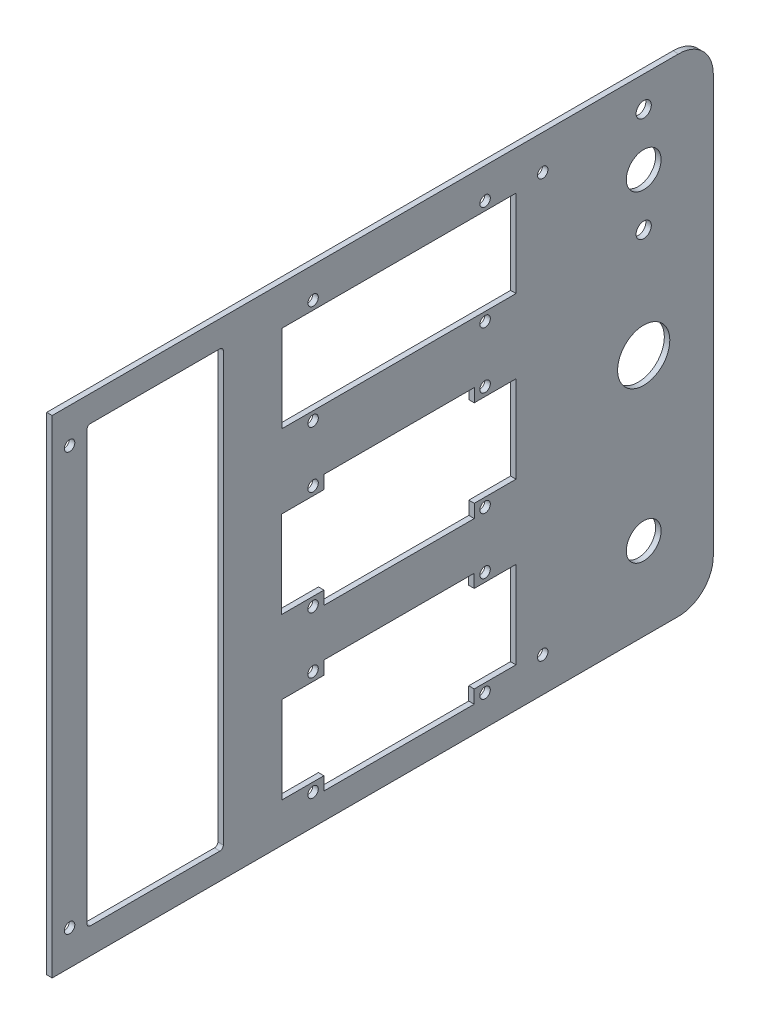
ISO-10303-21;
HEADER;
FILE_DESCRIPTION(('STEP AP214'),'2;1');
FILE_NAME('part.step','',(''),(''),'','','');
FILE_SCHEMA(('AUTOMOTIVE_DESIGN { 1 0 10303 214 1 1 1 1 }'));
ENDSEC;
DATA;
#1=APPLICATION_CONTEXT('core data for automotive mechanical design processes');
#2=APPLICATION_PROTOCOL_DEFINITION('international standard','automotive_design',2000,#1);
#3=PRODUCT_CONTEXT('',#1,'mechanical');
#4=PRODUCT('Part','Part','',(#3));
#5=PRODUCT_RELATED_PRODUCT_CATEGORY('part','',(#4));
#6=PRODUCT_DEFINITION_FORMATION('','',#4);
#7=PRODUCT_DEFINITION_CONTEXT('part definition',#1,'design');
#8=PRODUCT_DEFINITION('design','',#6,#7);
#9=PRODUCT_DEFINITION_SHAPE('','',#8);
#10=(LENGTH_UNIT() NAMED_UNIT(*) SI_UNIT(.MILLI.,.METRE.));
#11=(NAMED_UNIT(*) PLANE_ANGLE_UNIT() SI_UNIT($,.RADIAN.));
#12=(NAMED_UNIT(*) SI_UNIT($,.STERADIAN.) SOLID_ANGLE_UNIT());
#13=UNCERTAINTY_MEASURE_WITH_UNIT(LENGTH_MEASURE(1.E-05),#10,'distance_accuracy_value','');
#14=(GEOMETRIC_REPRESENTATION_CONTEXT(3) GLOBAL_UNCERTAINTY_ASSIGNED_CONTEXT((#13)) GLOBAL_UNIT_ASSIGNED_CONTEXT((#10,
#11,#12)) REPRESENTATION_CONTEXT('',''));
#15=CARTESIAN_POINT('',(0.,0.,0.));
#16=DIRECTION('',(0.,0.,1.));
#17=DIRECTION('',(1.,0.,0.));
#18=AXIS2_PLACEMENT_3D('',#15,#16,#17);
#19=CARTESIAN_POINT('',(909.536268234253,488.158909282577,-5.73581048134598E-13));
#20=DIRECTION('',(0.,1.,0.));
#21=DIRECTION('',(0.,0.,1.));
#22=AXIS2_PLACEMENT_3D('',#19,#20,#21);
#23=PLANE('',#22);
#24=DIRECTION('',(0.,0.,-1.));
#25=VECTOR('',#24,1.);
#26=CARTESIAN_POINT('',(907.536268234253,488.158909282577,-5.73581048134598E-13));
#27=LINE('',#26,#25);
#28=CARTESIAN_POINT('',(907.536268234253,488.158909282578,942.794638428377));
#29=VERTEX_POINT('',#28);
#30=CARTESIAN_POINT('',(907.536268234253,488.158909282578,895.550638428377));
#31=VERTEX_POINT('',#30);
#32=EDGE_CURVE('E569',#29,#31,#27,.T.);
#33=ORIENTED_EDGE('',*,*,#32,.F.);
#34=DIRECTION('',(-1.,0.,0.));
#35=VECTOR('',#34,1.);
#36=CARTESIAN_POINT('',(909.536268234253,488.158909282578,942.794638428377));
#37=LINE('',#36,#35);
#38=CARTESIAN_POINT('',(909.536268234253,488.158909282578,942.794638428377));
#39=VERTEX_POINT('',#38);
#40=EDGE_CURVE('E11',#39,#29,#37,.T.);
#41=ORIENTED_EDGE('',*,*,#40,.F.);
#42=DIRECTION('',(0.,0.,-1.));
#43=VECTOR('',#42,1.);
#44=CARTESIAN_POINT('',(909.536268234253,488.158909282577,-5.73581048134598E-13));
#45=LINE('',#44,#43);
#46=CARTESIAN_POINT('',(909.536268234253,488.158909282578,895.550638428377));
#47=VERTEX_POINT('',#46);
#48=EDGE_CURVE('E990',#39,#47,#45,.T.);
#49=ORIENTED_EDGE('',*,*,#48,.T.);
#50=DIRECTION('',(-1.,0.,0.));
#51=VECTOR('',#50,1.);
#52=CARTESIAN_POINT('',(909.536268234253,488.158909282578,895.550638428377));
#53=LINE('',#52,#51);
#54=EDGE_CURVE('E61',#47,#31,#53,.T.);
#55=ORIENTED_EDGE('',*,*,#54,.T.);
#56=EDGE_LOOP('',(#33,#41,#49,#55));
#57=FACE_BOUND('',#56,.T.);
#58=ADVANCED_FACE('F41',(#57),#23,.T.);
#59=CARTESIAN_POINT('',(909.536268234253,489.428909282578,942.794638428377));
#60=DIRECTION('',(-1.,0.,0.));
#61=DIRECTION('',(0.,0.,1.));
#62=AXIS2_PLACEMENT_3D('',#59,#60,#61);
#63=CYLINDRICAL_SURFACE('',#62,1.26999999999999);
#64=CARTESIAN_POINT('',(907.536268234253,489.428909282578,942.794638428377));
#65=DIRECTION('',(1.,0.,0.));
#66=DIRECTION('',(0.,0.,-1.));
#67=AXIS2_PLACEMENT_3D('',#64,#65,#66);
#68=CIRCLE('',#67,1.26999999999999);
#69=CARTESIAN_POINT('',(907.536268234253,489.428909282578,944.064638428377));
#70=VERTEX_POINT('',#69);
#71=EDGE_CURVE('E572',#29,#70,#68,.F.);
#72=ORIENTED_EDGE('',*,*,#71,.T.);
#73=DIRECTION('',(-1.,0.,0.));
#74=VECTOR('',#73,1.);
#75=CARTESIAN_POINT('',(909.536268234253,489.428909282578,944.064638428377));
#76=LINE('',#75,#74);
#77=CARTESIAN_POINT('',(909.536268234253,489.428909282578,944.064638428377));
#78=VERTEX_POINT('',#77);
#79=EDGE_CURVE('E52',#78,#70,#76,.T.);
#80=ORIENTED_EDGE('',*,*,#79,.F.);
#81=CARTESIAN_POINT('',(909.536268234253,489.428909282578,942.794638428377));
#82=DIRECTION('',(1.,0.,0.));
#83=DIRECTION('',(0.,0.,-1.));
#84=AXIS2_PLACEMENT_3D('',#81,#82,#83);
#85=CIRCLE('',#84,1.26999999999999);
#86=EDGE_CURVE('E993',#39,#78,#85,.F.);
#87=ORIENTED_EDGE('',*,*,#86,.F.);
#88=ORIENTED_EDGE('',*,*,#40,.T.);
#89=EDGE_LOOP('',(#72,#80,#87,#88));
#90=FACE_BOUND('',#89,.T.);
#91=ADVANCED_FACE('F1029',(#90),#63,.F.);
#92=CARTESIAN_POINT('',(909.536268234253,0.,944.064638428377));
#93=DIRECTION('',(0.,0.,1.));
#94=DIRECTION('',(1.,0.,0.));
#95=AXIS2_PLACEMENT_3D('',#92,#93,#94);
#96=PLANE('',#95);
#97=DIRECTION('',(0.,1.,0.));
#98=VECTOR('',#97,1.);
#99=CARTESIAN_POINT('',(907.536268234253,0.,944.064638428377));
#100=LINE('',#99,#98);
#101=CARTESIAN_POINT('',(907.536268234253,645.638909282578,944.064638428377));
#102=VERTEX_POINT('',#101);
#103=EDGE_CURVE('E576',#70,#102,#100,.T.);
#104=ORIENTED_EDGE('',*,*,#103,.T.);
#105=DIRECTION('',(-1.,0.,0.));
#106=VECTOR('',#105,1.);
#107=CARTESIAN_POINT('',(909.536268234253,645.638909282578,944.064638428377));
#108=LINE('',#107,#106);
#109=CARTESIAN_POINT('',(909.536268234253,645.638909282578,944.064638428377));
#110=VERTEX_POINT('',#109);
#111=EDGE_CURVE('E627',#110,#102,#108,.T.);
#112=ORIENTED_EDGE('',*,*,#111,.F.);
#113=DIRECTION('',(0.,1.,0.));
#114=VECTOR('',#113,1.);
#115=CARTESIAN_POINT('',(909.536268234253,0.,944.064638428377));
#116=LINE('',#115,#114);
#117=EDGE_CURVE('E997',#78,#110,#116,.T.);
#118=ORIENTED_EDGE('',*,*,#117,.F.);
#119=ORIENTED_EDGE('',*,*,#79,.T.);
#120=EDGE_LOOP('',(#104,#112,#118,#119));
#121=FACE_BOUND('',#120,.T.);
#122=ADVANCED_FACE('F1034',(#121),#96,.F.);
#123=CARTESIAN_POINT('',(909.536268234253,645.638909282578,942.794638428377));
#124=DIRECTION('',(-1.,0.,0.));
#125=DIRECTION('',(0.,0.,1.));
#126=AXIS2_PLACEMENT_3D('',#123,#124,#125);
#127=CYLINDRICAL_SURFACE('',#126,1.26999999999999);
#128=CARTESIAN_POINT('',(907.536268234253,645.638909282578,942.794638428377));
#129=DIRECTION('',(1.,0.,0.));
#130=DIRECTION('',(0.,0.,-1.));
#131=AXIS2_PLACEMENT_3D('',#128,#129,#130);
#132=CIRCLE('',#131,1.26999999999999);
#133=CARTESIAN_POINT('',(907.536268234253,646.908909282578,942.794638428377));
#134=VERTEX_POINT('',#133);
#135=EDGE_CURVE('E580',#134,#102,#132,.T.);
#136=ORIENTED_EDGE('',*,*,#135,.F.);
#137=DIRECTION('',(-1.,0.,0.));
#138=VECTOR('',#137,1.);
#139=CARTESIAN_POINT('',(909.536268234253,646.908909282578,942.794638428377));
#140=LINE('',#139,#138);
#141=CARTESIAN_POINT('',(909.536268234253,646.908909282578,942.794638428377));
#142=VERTEX_POINT('',#141);
#143=EDGE_CURVE('E624',#142,#134,#140,.T.);
#144=ORIENTED_EDGE('',*,*,#143,.F.);
#145=CARTESIAN_POINT('',(909.536268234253,645.638909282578,942.794638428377));
#146=DIRECTION('',(1.,0.,0.));
#147=DIRECTION('',(0.,0.,-1.));
#148=AXIS2_PLACEMENT_3D('',#145,#146,#147);
#149=CIRCLE('',#148,1.26999999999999);
#150=EDGE_CURVE('E1000',#142,#110,#149,.T.);
#151=ORIENTED_EDGE('',*,*,#150,.T.);
#152=ORIENTED_EDGE('',*,*,#111,.T.);
#153=EDGE_LOOP('',(#136,#144,#151,#152));
#154=FACE_BOUND('',#153,.T.);
#155=ADVANCED_FACE('F1329',(#154),#127,.F.);
#156=CARTESIAN_POINT('',(909.536268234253,646.908909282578,0.));
#157=DIRECTION('',(0.,-1.,0.));
#158=DIRECTION('',(0.,0.,-1.));
#159=AXIS2_PLACEMENT_3D('',#156,#157,#158);
#160=PLANE('',#159);
#161=DIRECTION('',(0.,0.,1.));
#162=VECTOR('',#161,1.);
#163=CARTESIAN_POINT('',(907.536268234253,646.908909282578,0.));
#164=LINE('',#163,#162);
#165=CARTESIAN_POINT('',(907.536268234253,646.908909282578,895.550638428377));
#166=VERTEX_POINT('',#165);
#167=EDGE_CURVE('E584',#166,#134,#164,.T.);
#168=ORIENTED_EDGE('',*,*,#167,.F.);
#169=DIRECTION('',(-1.,0.,0.));
#170=VECTOR('',#169,1.);
#171=CARTESIAN_POINT('',(909.536268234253,646.908909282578,895.550638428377));
#172=LINE('',#171,#170);
#173=CARTESIAN_POINT('',(909.536268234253,646.908909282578,895.550638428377));
#174=VERTEX_POINT('',#173);
#175=EDGE_CURVE('E328',#174,#166,#172,.T.);
#176=ORIENTED_EDGE('',*,*,#175,.F.);
#177=DIRECTION('',(0.,0.,1.));
#178=VECTOR('',#177,1.);
#179=CARTESIAN_POINT('',(909.536268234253,646.908909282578,0.));
#180=LINE('',#179,#178);
#181=EDGE_CURVE('E340',#174,#142,#180,.T.);
#182=ORIENTED_EDGE('',*,*,#181,.T.);
#183=ORIENTED_EDGE('',*,*,#143,.T.);
#184=EDGE_LOOP('',(#168,#176,#182,#183));
#185=FACE_BOUND('',#184,.T.);
#186=ADVANCED_FACE('F1007',(#185),#160,.T.);
#187=CARTESIAN_POINT('',(909.536268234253,645.638909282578,895.550638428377));
#188=DIRECTION('',(-1.,0.,0.));
#189=DIRECTION('',(0.,0.,1.));
#190=AXIS2_PLACEMENT_3D('',#187,#188,#189);
#191=CYLINDRICAL_SURFACE('',#190,1.26999999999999);
#192=CARTESIAN_POINT('',(907.536268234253,645.638909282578,895.550638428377));
#193=DIRECTION('',(1.,0.,0.));
#194=DIRECTION('',(0.,0.,-1.));
#195=AXIS2_PLACEMENT_3D('',#192,#193,#194);
#196=CIRCLE('',#195,1.26999999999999);
#197=CARTESIAN_POINT('',(907.536268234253,645.638909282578,894.280638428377));
#198=VERTEX_POINT('',#197);
#199=EDGE_CURVE('E323',#198,#166,#196,.T.);
#200=ORIENTED_EDGE('',*,*,#199,.F.);
#201=DIRECTION('',(-1.,0.,0.));
#202=VECTOR('',#201,1.);
#203=CARTESIAN_POINT('',(909.536268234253,645.638909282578,894.280638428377));
#204=LINE('',#203,#202);
#205=CARTESIAN_POINT('',(909.536268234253,645.638909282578,894.280638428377));
#206=VERTEX_POINT('',#205);
#207=EDGE_CURVE('E318',#206,#198,#204,.T.);
#208=ORIENTED_EDGE('',*,*,#207,.F.);
#209=CARTESIAN_POINT('',(909.536268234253,645.638909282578,895.550638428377));
#210=DIRECTION('',(1.,0.,0.));
#211=DIRECTION('',(0.,0.,-1.));
#212=AXIS2_PLACEMENT_3D('',#209,#210,#211);
#213=CIRCLE('',#212,1.26999999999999);
#214=EDGE_CURVE('E321',#206,#174,#213,.T.);
#215=ORIENTED_EDGE('',*,*,#214,.T.);
#216=ORIENTED_EDGE('',*,*,#175,.T.);
#217=EDGE_LOOP('',(#200,#208,#215,#216));
#218=FACE_BOUND('',#217,.T.);
#219=ADVANCED_FACE('F320',(#218),#191,.F.);
#220=CARTESIAN_POINT('',(909.536268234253,0.,894.280638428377));
#221=DIRECTION('',(0.,0.,1.));
#222=DIRECTION('',(1.,0.,0.));
#223=AXIS2_PLACEMENT_3D('',#220,#221,#222);
#224=PLANE('',#223);
#225=DIRECTION('',(0.,1.,0.));
#226=VECTOR('',#225,1.);
#227=CARTESIAN_POINT('',(907.536268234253,0.,894.280638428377));
#228=LINE('',#227,#226);
#229=CARTESIAN_POINT('',(907.536268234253,489.428909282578,894.280638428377));
#230=VERTEX_POINT('',#229);
#231=EDGE_CURVE('E590',#230,#198,#228,.T.);
#232=ORIENTED_EDGE('',*,*,#231,.F.);
#233=DIRECTION('',(-1.,0.,0.));
#234=VECTOR('',#233,1.);
#235=CARTESIAN_POINT('',(909.536268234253,489.428909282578,894.280638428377));
#236=LINE('',#235,#234);
#237=CARTESIAN_POINT('',(909.536268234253,489.428909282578,894.280638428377));
#238=VERTEX_POINT('',#237);
#239=EDGE_CURVE('E188',#238,#230,#236,.T.);
#240=ORIENTED_EDGE('',*,*,#239,.F.);
#241=DIRECTION('',(0.,1.,0.));
#242=VECTOR('',#241,1.);
#243=CARTESIAN_POINT('',(909.536268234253,0.,894.280638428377));
#244=LINE('',#243,#242);
#245=EDGE_CURVE('E337',#238,#206,#244,.T.);
#246=ORIENTED_EDGE('',*,*,#245,.T.);
#247=ORIENTED_EDGE('',*,*,#207,.T.);
#248=EDGE_LOOP('',(#232,#240,#246,#247));
#249=FACE_BOUND('',#248,.T.);
#250=ADVANCED_FACE('F343',(#249),#224,.T.);
#251=CARTESIAN_POINT('',(909.536268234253,656.433909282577,-3.82565977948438E-13));
#252=DIRECTION('',(0.,1.,0.));
#253=DIRECTION('',(0.,0.,1.));
#254=AXIS2_PLACEMENT_3D('',#251,#252,#253);
#255=PLANE('',#254);
#256=DIRECTION('',(0.,0.,-1.));
#257=VECTOR('',#256,1.);
#258=CARTESIAN_POINT('',(907.536268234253,656.433909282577,-3.82565977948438E-13));
#259=LINE('',#258,#257);
#260=CARTESIAN_POINT('',(907.536268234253,656.433909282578,956.76463842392));
#261=VERTEX_POINT('',#260);
#262=CARTESIAN_POINT('',(907.536268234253,656.433909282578,728.16467704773));
#263=VERTEX_POINT('',#262);
#264=EDGE_CURVE('E546',#261,#263,#259,.T.);
#265=ORIENTED_EDGE('',*,*,#264,.F.);
#266=DIRECTION('',(-1.,0.,0.));
#267=VECTOR('',#266,1.);
#268=CARTESIAN_POINT('',(909.536268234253,656.433909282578,956.76463842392));
#269=LINE('',#268,#267);
#270=CARTESIAN_POINT('',(909.536268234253,656.433909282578,956.76463842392));
#271=VERTEX_POINT('',#270);
#272=EDGE_CURVE('E620',#271,#261,#269,.T.);
#273=ORIENTED_EDGE('',*,*,#272,.F.);
#274=DIRECTION('',(0.,0.,-1.));
#275=VECTOR('',#274,1.);
#276=CARTESIAN_POINT('',(909.536268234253,656.433909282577,-3.82565977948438E-13));
#277=LINE('',#276,#275);
#278=CARTESIAN_POINT('',(909.536268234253,656.433909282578,728.16467704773));
#279=VERTEX_POINT('',#278);
#280=EDGE_CURVE('E967',#271,#279,#277,.T.);
#281=ORIENTED_EDGE('',*,*,#280,.T.);
#282=DIRECTION('',(-1.,0.,0.));
#283=VECTOR('',#282,1.);
#284=CARTESIAN_POINT('',(909.536268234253,656.433909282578,728.16467704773));
#285=LINE('',#284,#283);
#286=EDGE_CURVE('E633',#279,#263,#285,.T.);
#287=ORIENTED_EDGE('',*,*,#286,.T.);
#288=EDGE_LOOP('',(#265,#273,#281,#287));
#289=FACE_BOUND('',#288,.T.);
#290=ADVANCED_FACE('F1055',(#289),#255,.T.);
#291=CARTESIAN_POINT('',(909.536268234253,0.,956.76463842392));
#292=DIRECTION('',(0.,0.,-1.));
#293=DIRECTION('',(-1.,0.,0.));
#294=AXIS2_PLACEMENT_3D('',#291,#292,#293);
#295=PLANE('',#294);
#296=DIRECTION('',(0.,-1.,0.));
#297=VECTOR('',#296,1.);
#298=CARTESIAN_POINT('',(907.536268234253,0.,956.76463842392));
#299=LINE('',#298,#297);
#300=CARTESIAN_POINT('',(907.536268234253,478.633909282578,956.76463842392));
#301=VERTEX_POINT('',#300);
#302=EDGE_CURVE('E549',#261,#301,#299,.T.);
#303=ORIENTED_EDGE('',*,*,#302,.T.);
#304=DIRECTION('',(-1.,0.,0.));
#305=VECTOR('',#304,1.);
#306=CARTESIAN_POINT('',(909.536268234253,478.633909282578,956.76463842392));
#307=LINE('',#306,#305);
#308=CARTESIAN_POINT('',(909.536268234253,478.633909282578,956.76463842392));
#309=VERTEX_POINT('',#308);
#310=EDGE_CURVE('E648',#309,#301,#307,.T.);
#311=ORIENTED_EDGE('',*,*,#310,.F.);
#312=DIRECTION('',(0.,-1.,0.));
#313=VECTOR('',#312,1.);
#314=CARTESIAN_POINT('',(909.536268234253,0.,956.76463842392));
#315=LINE('',#314,#313);
#316=EDGE_CURVE('E971',#271,#309,#315,.T.);
#317=ORIENTED_EDGE('',*,*,#316,.F.);
#318=ORIENTED_EDGE('',*,*,#272,.T.);
#319=EDGE_LOOP('',(#303,#311,#317,#318));
#320=FACE_BOUND('',#319,.T.);
#321=ADVANCED_FACE('F1051',(#320),#295,.F.);
#322=CARTESIAN_POINT('',(909.536268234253,478.633909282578,1.39472570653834E-13));
#323=DIRECTION('',(0.,1.,0.));
#324=DIRECTION('',(0.,0.,1.));
#325=AXIS2_PLACEMENT_3D('',#322,#323,#324);
#326=PLANE('',#325);
#327=DIRECTION('',(0.,0.,-1.));
#328=VECTOR('',#327,1.);
#329=CARTESIAN_POINT('',(907.536268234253,478.633909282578,1.39472570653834E-13));
#330=LINE('',#329,#328);
#331=CARTESIAN_POINT('',(907.536268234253,478.633909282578,728.16467704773));
#332=VERTEX_POINT('',#331);
#333=EDGE_CURVE('E553',#301,#332,#330,.T.);
#334=ORIENTED_EDGE('',*,*,#333,.T.);
#335=DIRECTION('',(-1.,0.,0.));
#336=VECTOR('',#335,1.);
#337=CARTESIAN_POINT('',(909.536268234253,478.633909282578,728.16467704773));
#338=LINE('',#337,#336);
#339=CARTESIAN_POINT('',(909.536268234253,478.633909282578,728.16467704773));
#340=VERTEX_POINT('',#339);
#341=EDGE_CURVE('E644',#340,#332,#338,.T.);
#342=ORIENTED_EDGE('',*,*,#341,.F.);
#343=DIRECTION('',(0.,0.,-1.));
#344=VECTOR('',#343,1.);
#345=CARTESIAN_POINT('',(909.536268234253,478.633909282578,1.39472570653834E-13));
#346=LINE('',#345,#344);
#347=EDGE_CURVE('E975',#309,#340,#346,.T.);
#348=ORIENTED_EDGE('',*,*,#347,.F.);
#349=ORIENTED_EDGE('',*,*,#310,.T.);
#350=EDGE_LOOP('',(#334,#342,#348,#349));
#351=FACE_BOUND('',#350,.T.);
#352=ADVANCED_FACE('F1047',(#351),#326,.F.);
#353=CARTESIAN_POINT('',(909.536268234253,491.333909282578,728.16467704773));
#354=DIRECTION('',(-1.,0.,0.));
#355=DIRECTION('',(0.,0.,1.));
#356=AXIS2_PLACEMENT_3D('',#353,#354,#355);
#357=CYLINDRICAL_SURFACE('',#356,12.7);
#358=CARTESIAN_POINT('',(907.536268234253,491.333909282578,728.16467704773));
#359=DIRECTION('',(1.,0.,0.));
#360=DIRECTION('',(0.,0.,-1.));
#361=AXIS2_PLACEMENT_3D('',#358,#359,#360);
#362=CIRCLE('',#361,12.7);
#363=CARTESIAN_POINT('',(907.536268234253,491.333909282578,715.46467704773));
#364=VERTEX_POINT('',#363);
#365=EDGE_CURVE('E557',#332,#364,#362,.T.);
#366=ORIENTED_EDGE('',*,*,#365,.T.);
#367=DIRECTION('',(-1.,0.,0.));
#368=VECTOR('',#367,1.);
#369=CARTESIAN_POINT('',(909.536268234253,491.333909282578,715.46467704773));
#370=LINE('',#369,#368);
#371=CARTESIAN_POINT('',(909.536268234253,491.333909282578,715.46467704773));
#372=VERTEX_POINT('',#371);
#373=EDGE_CURVE('E640',#372,#364,#370,.T.);
#374=ORIENTED_EDGE('',*,*,#373,.F.);
#375=CARTESIAN_POINT('',(909.536268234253,491.333909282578,728.16467704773));
#376=DIRECTION('',(1.,0.,0.));
#377=DIRECTION('',(0.,0.,-1.));
#378=AXIS2_PLACEMENT_3D('',#375,#376,#377);
#379=CIRCLE('',#378,12.7);
#380=EDGE_CURVE('E979',#340,#372,#379,.T.);
#381=ORIENTED_EDGE('',*,*,#380,.F.);
#382=ORIENTED_EDGE('',*,*,#341,.T.);
#383=EDGE_LOOP('',(#366,#374,#381,#382));
#384=FACE_BOUND('',#383,.T.);
#385=ADVANCED_FACE('F1043',(#384),#357,.T.);
#386=CARTESIAN_POINT('',(909.536268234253,0.,715.46467704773));
#387=DIRECTION('',(0.,0.,1.));
#388=DIRECTION('',(1.,0.,0.));
#389=AXIS2_PLACEMENT_3D('',#386,#387,#388);
#390=PLANE('',#389);
#391=DIRECTION('',(0.,1.,0.));
#392=VECTOR('',#391,1.);
#393=CARTESIAN_POINT('',(907.536268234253,0.,715.46467704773));
#394=LINE('',#393,#392);
#395=CARTESIAN_POINT('',(907.536268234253,643.733909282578,715.46467704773));
#396=VERTEX_POINT('',#395);
#397=EDGE_CURVE('E561',#364,#396,#394,.T.);
#398=ORIENTED_EDGE('',*,*,#397,.T.);
#399=DIRECTION('',(-1.,0.,0.));
#400=VECTOR('',#399,1.);
#401=CARTESIAN_POINT('',(909.536268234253,643.733909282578,715.46467704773));
#402=LINE('',#401,#400);
#403=CARTESIAN_POINT('',(909.536268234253,643.733909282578,715.46467704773));
#404=VERTEX_POINT('',#403);
#405=EDGE_CURVE('E636',#404,#396,#402,.T.);
#406=ORIENTED_EDGE('',*,*,#405,.F.);
#407=DIRECTION('',(0.,1.,0.));
#408=VECTOR('',#407,1.);
#409=CARTESIAN_POINT('',(909.536268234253,0.,715.46467704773));
#410=LINE('',#409,#408);
#411=EDGE_CURVE('E983',#372,#404,#410,.T.);
#412=ORIENTED_EDGE('',*,*,#411,.F.);
#413=ORIENTED_EDGE('',*,*,#373,.T.);
#414=EDGE_LOOP('',(#398,#406,#412,#413));
#415=FACE_BOUND('',#414,.T.);
#416=ADVANCED_FACE('F1039',(#415),#390,.F.);
#417=CARTESIAN_POINT('',(909.536268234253,0.140858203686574,787.577740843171));
#418=DIRECTION('',(0.,0.00017884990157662,0.999999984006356));
#419=DIRECTION('',(0.,-0.999999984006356,0.00017884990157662));
#420=AXIS2_PLACEMENT_3D('',#417,#418,#419);
#421=PLANE('',#420);
#422=DIRECTION('',(0.,0.999999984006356,-0.00017884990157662));
#423=VECTOR('',#422,1.);
#424=CARTESIAN_POINT('',(907.536268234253,0.140858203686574,787.577740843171));
#425=LINE('',#424,#423);
#426=CARTESIAN_POINT('',(907.536268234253,610.332773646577,787.468608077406));
#427=VERTEX_POINT('',#426);
#428=CARTESIAN_POINT('',(907.536268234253,642.083094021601,787.462929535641));
#429=VERTEX_POINT('',#428);
#430=EDGE_CURVE('E466',#427,#429,#425,.T.);
#431=ORIENTED_EDGE('',*,*,#430,.F.);
#432=DIRECTION('',(-1.,0.,0.));
#433=VECTOR('',#432,1.);
#434=CARTESIAN_POINT('',(909.536268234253,610.332773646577,787.468608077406));
#435=LINE('',#434,#433);
#436=CARTESIAN_POINT('',(909.536268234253,610.332773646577,787.468608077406));
#437=VERTEX_POINT('',#436);
#438=EDGE_CURVE('E637',#437,#427,#435,.T.);
#439=ORIENTED_EDGE('',*,*,#438,.F.);
#440=DIRECTION('',(0.,0.999999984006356,-0.00017884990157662));
#441=VECTOR('',#440,1.);
#442=CARTESIAN_POINT('',(909.536268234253,0.140858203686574,787.577740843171));
#443=LINE('',#442,#441);
#444=CARTESIAN_POINT('',(909.536268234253,642.083094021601,787.462929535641));
#445=VERTEX_POINT('',#444);
#446=EDGE_CURVE('E888',#437,#445,#443,.T.);
#447=ORIENTED_EDGE('',*,*,#446,.T.);
#448=DIRECTION('',(-1.,0.,0.));
#449=VECTOR('',#448,1.);
#450=CARTESIAN_POINT('',(909.536268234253,642.083094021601,787.462929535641));
#451=LINE('',#450,#449);
#452=EDGE_CURVE('E654',#445,#429,#451,.T.);
#453=ORIENTED_EDGE('',*,*,#452,.T.);
#454=EDGE_LOOP('',(#431,#439,#447,#453));
#455=FACE_BOUND('',#454,.T.);
#456=ADVANCED_FACE('F1042',(#455),#421,.T.);
#457=CARTESIAN_POINT('',(909.536268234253,610.332773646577,0.));
#458=DIRECTION('',(0.,-1.,0.));
#459=DIRECTION('',(0.,0.,-1.));
#460=AXIS2_PLACEMENT_3D('',#457,#458,#459);
#461=PLANE('',#460);
#462=DIRECTION('',(0.,0.,1.));
#463=VECTOR('',#462,1.);
#464=CARTESIAN_POINT('',(907.536268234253,610.332773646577,0.));
#465=LINE('',#464,#463);
#466=CARTESIAN_POINT('',(907.536268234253,610.332773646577,872.807864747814));
#467=VERTEX_POINT('',#466);
#468=EDGE_CURVE('E470',#427,#467,#465,.T.);
#469=ORIENTED_EDGE('',*,*,#468,.T.);
#470=DIRECTION('',(-1.,0.,0.));
#471=VECTOR('',#470,1.);
#472=CARTESIAN_POINT('',(909.536268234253,610.332773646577,872.807864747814));
#473=LINE('',#472,#471);
#474=CARTESIAN_POINT('',(909.536268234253,610.332773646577,872.807864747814));
#475=VERTEX_POINT('',#474);
#476=EDGE_CURVE('E661',#475,#467,#473,.T.);
#477=ORIENTED_EDGE('',*,*,#476,.F.);
#478=DIRECTION('',(0.,0.,1.));
#479=VECTOR('',#478,1.);
#480=CARTESIAN_POINT('',(909.536268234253,610.332773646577,0.));
#481=LINE('',#480,#479);
#482=EDGE_CURVE('E892',#437,#475,#481,.T.);
#483=ORIENTED_EDGE('',*,*,#482,.F.);
#484=ORIENTED_EDGE('',*,*,#438,.T.);
#485=EDGE_LOOP('',(#469,#477,#483,#484));
#486=FACE_BOUND('',#485,.T.);
#487=ADVANCED_FACE('F1132',(#486),#461,.F.);
#488=CARTESIAN_POINT('',(909.536268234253,0.,872.807864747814));
#489=DIRECTION('',(0.,0.,1.));
#490=DIRECTION('',(1.,0.,0.));
#491=AXIS2_PLACEMENT_3D('',#488,#489,#490);
#492=PLANE('',#491);
#493=DIRECTION('',(0.,1.,0.));
#494=VECTOR('',#493,1.);
#495=CARTESIAN_POINT('',(907.536268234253,0.,872.807864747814));
#496=LINE('',#495,#494);
#497=CARTESIAN_POINT('',(907.536268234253,642.083094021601,872.807864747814));
#498=VERTEX_POINT('',#497);
#499=EDGE_CURVE('E474',#467,#498,#496,.T.);
#500=ORIENTED_EDGE('',*,*,#499,.T.);
#501=DIRECTION('',(-1.,0.,0.));
#502=VECTOR('',#501,1.);
#503=CARTESIAN_POINT('',(909.536268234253,642.083094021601,872.807864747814));
#504=LINE('',#503,#502);
#505=CARTESIAN_POINT('',(909.536268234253,642.083094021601,872.807864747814));
#506=VERTEX_POINT('',#505);
#507=EDGE_CURVE('E657',#506,#498,#504,.T.);
#508=ORIENTED_EDGE('',*,*,#507,.F.);
#509=DIRECTION('',(0.,1.,0.));
#510=VECTOR('',#509,1.);
#511=CARTESIAN_POINT('',(909.536268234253,0.,872.807864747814));
#512=LINE('',#511,#510);
#513=EDGE_CURVE('E896',#475,#506,#512,.T.);
#514=ORIENTED_EDGE('',*,*,#513,.F.);
#515=ORIENTED_EDGE('',*,*,#476,.T.);
#516=EDGE_LOOP('',(#500,#508,#514,#515));
#517=FACE_BOUND('',#516,.T.);
#518=ADVANCED_FACE('F1128',(#517),#492,.F.);
#519=CARTESIAN_POINT('',(909.536268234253,6.15972037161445E-05,787.473468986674));
#520=DIRECTION('',(0.,7.82213066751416E-08,0.999999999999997));
#521=DIRECTION('',(0.,-0.999999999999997,7.82213066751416E-08));
#522=AXIS2_PLACEMENT_3D('',#519,#520,#521);
#523=PLANE('',#522);
#524=DIRECTION('',(0.,0.999999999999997,-7.82213066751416E-08));
#525=VECTOR('',#524,1.);
#526=CARTESIAN_POINT('',(907.536268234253,6.15972037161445E-05,787.473468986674));
#527=LINE('',#526,#525);
#528=CARTESIAN_POINT('',(907.536268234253,551.658902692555,787.473424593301));
#529=VERTEX_POINT('',#528);
#530=CARTESIAN_POINT('',(907.536268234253,583.409223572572,787.473423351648));
#531=VERTEX_POINT('',#530);
#532=EDGE_CURVE('E418',#529,#531,#527,.T.);
#533=ORIENTED_EDGE('',*,*,#532,.F.);
#534=DIRECTION('',(-1.,0.,0.));
#535=VECTOR('',#534,1.);
#536=CARTESIAN_POINT('',(909.536268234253,551.658902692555,787.473424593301));
#537=LINE('',#536,#535);
#538=CARTESIAN_POINT('',(909.536268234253,551.658902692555,787.473424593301));
#539=VERTEX_POINT('',#538);
#540=EDGE_CURVE('E658',#539,#529,#537,.T.);
#541=ORIENTED_EDGE('',*,*,#540,.F.);
#542=DIRECTION('',(0.,0.999999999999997,-7.82213066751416E-08));
#543=VECTOR('',#542,1.);
#544=CARTESIAN_POINT('',(909.536268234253,6.15972037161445E-05,787.473468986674));
#545=LINE('',#544,#543);
#546=CARTESIAN_POINT('',(909.536268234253,583.409223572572,787.473423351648));
#547=VERTEX_POINT('',#546);
#548=EDGE_CURVE('E841',#539,#547,#545,.T.);
#549=ORIENTED_EDGE('',*,*,#548,.T.);
#550=DIRECTION('',(-1.,0.,0.));
#551=VECTOR('',#550,1.);
#552=CARTESIAN_POINT('',(909.536268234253,583.409223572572,787.473423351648));
#553=LINE('',#552,#551);
#554=EDGE_CURVE('E667',#547,#531,#553,.T.);
#555=ORIENTED_EDGE('',*,*,#554,.T.);
#556=EDGE_LOOP('',(#533,#541,#549,#555));
#557=FACE_BOUND('',#556,.T.);
#558=ADVANCED_FACE('F1131',(#557),#523,.T.);
#559=CARTESIAN_POINT('',(909.536268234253,551.79966303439,0.098646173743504));
#560=DIRECTION('',(0.,-0.999999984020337,-0.000178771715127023));
#561=DIRECTION('',(0.,0.000178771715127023,-0.999999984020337));
#562=AXIS2_PLACEMENT_3D('',#559,#560,#561);
#563=PLANE('',#562);
#564=DIRECTION('',(0.,-0.000178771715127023,0.999999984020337));
#565=VECTOR('',#564,1.);
#566=CARTESIAN_POINT('',(907.536268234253,551.79966303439,0.098646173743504));
#567=LINE('',#566,#565);
#568=CARTESIAN_POINT('',(907.536268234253,551.656178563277,802.7114572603));
#569=VERTEX_POINT('',#568);
#570=EDGE_CURVE('E422',#529,#569,#567,.T.);
#571=ORIENTED_EDGE('',*,*,#570,.T.);
#572=DIRECTION('',(-1.,0.,0.));
#573=VECTOR('',#572,1.);
#574=CARTESIAN_POINT('',(909.536268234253,551.656178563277,802.7114572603));
#575=LINE('',#574,#573);
#576=CARTESIAN_POINT('',(909.536268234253,551.656178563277,802.7114572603));
#577=VERTEX_POINT('',#576);
#578=EDGE_CURVE('E701',#577,#569,#575,.T.);
#579=ORIENTED_EDGE('',*,*,#578,.F.);
#580=DIRECTION('',(0.,-0.000178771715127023,0.999999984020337));
#581=VECTOR('',#580,1.);
#582=CARTESIAN_POINT('',(909.536268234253,551.79966303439,0.098646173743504));
#583=LINE('',#582,#581);
#584=EDGE_CURVE('E845',#539,#577,#583,.T.);
#585=ORIENTED_EDGE('',*,*,#584,.F.);
#586=ORIENTED_EDGE('',*,*,#540,.T.);
#587=EDGE_LOOP('',(#571,#579,#585,#586));
#588=FACE_BOUND('',#587,.T.);
#589=ADVANCED_FACE('F1178',(#588),#563,.F.);
#590=CARTESIAN_POINT('',(909.536268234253,6.27891529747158E-05,802.711500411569));
#591=DIRECTION('',(0.,-7.82213197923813E-08,-0.999999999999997));
#592=DIRECTION('',(0.,0.999999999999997,-7.82213197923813E-08));
#593=AXIS2_PLACEMENT_3D('',#590,#591,#592);
#594=PLANE('',#593);
#595=DIRECTION('',(0.,-0.999999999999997,7.82213197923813E-08));
#596=VECTOR('',#595,1.);
#597=CARTESIAN_POINT('',(907.536268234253,6.27891529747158E-05,802.711500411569));
#598=LINE('',#597,#596);
#599=CARTESIAN_POINT('',(907.536268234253,546.832904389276,802.711457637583));
#600=VERTEX_POINT('',#599);
#601=EDGE_CURVE('E426',#569,#600,#598,.T.);
#602=ORIENTED_EDGE('',*,*,#601,.T.);
#603=DIRECTION('',(-1.,0.,0.));
#604=VECTOR('',#603,1.);
#605=CARTESIAN_POINT('',(909.536268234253,546.832904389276,802.711457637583));
#606=LINE('',#605,#604);
#607=CARTESIAN_POINT('',(909.536268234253,546.832904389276,802.711457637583));
#608=VERTEX_POINT('',#607);
#609=EDGE_CURVE('E697',#608,#600,#606,.T.);
#610=ORIENTED_EDGE('',*,*,#609,.F.);
#611=DIRECTION('',(0.,-0.999999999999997,7.82213197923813E-08));
#612=VECTOR('',#611,1.);
#613=CARTESIAN_POINT('',(909.536268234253,6.27891529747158E-05,802.711500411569));
#614=LINE('',#613,#612);
#615=EDGE_CURVE('E849',#577,#608,#614,.T.);
#616=ORIENTED_EDGE('',*,*,#615,.F.);
#617=ORIENTED_EDGE('',*,*,#578,.T.);
#618=EDGE_LOOP('',(#602,#610,#616,#617));
#619=FACE_BOUND('',#618,.T.);
#620=ADVANCED_FACE('F1174',(#619),#594,.F.);
#621=CARTESIAN_POINT('',(909.536268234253,546.832841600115,-4.27739919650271E-05));
#622=DIRECTION('',(0.,-0.999999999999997,7.82213296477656E-08));
#623=DIRECTION('',(0.,-7.82213296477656E-08,-0.999999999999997));
#624=AXIS2_PLACEMENT_3D('',#621,#622,#623);
#625=PLANE('',#624);
#626=DIRECTION('',(0.,7.82213296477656E-08,0.999999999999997));
#627=VECTOR('',#626,1.);
#628=CARTESIAN_POINT('',(907.536268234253,546.832841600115,-4.27739919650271E-05));
#629=LINE('',#628,#627);
#630=CARTESIAN_POINT('',(907.536268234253,546.832908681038,857.578361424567));
#631=VERTEX_POINT('',#630);
#632=EDGE_CURVE('E430',#600,#631,#629,.T.);
#633=ORIENTED_EDGE('',*,*,#632,.T.);
#634=DIRECTION('',(-1.,0.,0.));
#635=VECTOR('',#634,1.);
#636=CARTESIAN_POINT('',(909.536268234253,546.832908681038,857.578361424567));
#637=LINE('',#636,#635);
#638=CARTESIAN_POINT('',(909.536268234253,546.832908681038,857.578361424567));
#639=VERTEX_POINT('',#638);
#640=EDGE_CURVE('E693',#639,#631,#637,.T.);
#641=ORIENTED_EDGE('',*,*,#640,.F.);
#642=DIRECTION('',(0.,7.82213296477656E-08,0.999999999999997));
#643=VECTOR('',#642,1.);
#644=CARTESIAN_POINT('',(909.536268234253,546.832841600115,-4.27739919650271E-05));
#645=LINE('',#644,#643);
#646=EDGE_CURVE('E853',#608,#639,#645,.T.);
#647=ORIENTED_EDGE('',*,*,#646,.F.);
#648=ORIENTED_EDGE('',*,*,#609,.T.);
#649=EDGE_LOOP('',(#633,#641,#647,#648));
#650=FACE_BOUND('',#649,.T.);
#651=ADVANCED_FACE('F1170',(#650),#625,.F.);
#652=CARTESIAN_POINT('',(909.536268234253,6.70809245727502E-05,857.57840419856));
#653=DIRECTION('',(0.,7.82213314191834E-08,0.999999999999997));
#654=DIRECTION('',(0.,-0.999999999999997,7.82213314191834E-08));
#655=AXIS2_PLACEMENT_3D('',#652,#653,#654);
#656=PLANE('',#655);
#657=DIRECTION('',(0.,0.999999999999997,-7.82213314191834E-08));
#658=VECTOR('',#657,1.);
#659=CARTESIAN_POINT('',(907.536268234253,6.70809245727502E-05,857.57840419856));
#660=LINE('',#659,#658);
#661=CARTESIAN_POINT('',(907.536268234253,551.658908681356,857.578361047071));
#662=VERTEX_POINT('',#661);
#663=EDGE_CURVE('E434',#631,#662,#660,.T.);
#664=ORIENTED_EDGE('',*,*,#663,.T.);
#665=DIRECTION('',(-1.,0.,0.));
#666=VECTOR('',#665,1.);
#667=CARTESIAN_POINT('',(909.536268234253,551.658908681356,857.578361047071));
#668=LINE('',#667,#666);
#669=CARTESIAN_POINT('',(909.536268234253,551.658908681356,857.578361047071));
#670=VERTEX_POINT('',#669);
#671=EDGE_CURVE('E689',#670,#662,#668,.T.);
#672=ORIENTED_EDGE('',*,*,#671,.F.);
#673=DIRECTION('',(0.,0.999999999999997,-7.82213314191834E-08));
#674=VECTOR('',#673,1.);
#675=CARTESIAN_POINT('',(909.536268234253,6.70809245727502E-05,857.57840419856));
#676=LINE('',#675,#674);
#677=EDGE_CURVE('E857',#639,#670,#676,.T.);
#678=ORIENTED_EDGE('',*,*,#677,.F.);
#679=ORIENTED_EDGE('',*,*,#640,.T.);
#680=EDGE_LOOP('',(#664,#672,#678,#679));
#681=FACE_BOUND('',#680,.T.);
#682=ADVANCED_FACE('F1166',(#681),#656,.F.);
#683=CARTESIAN_POINT('',(909.536268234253,551.658841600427,-4.31514919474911E-05));
#684=DIRECTION('',(0.,-0.999999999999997,7.82213366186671E-08));
#685=DIRECTION('',(0.,-7.82213366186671E-08,-0.999999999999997));
#686=AXIS2_PLACEMENT_3D('',#683,#684,#685);
#687=PLANE('',#686);
#688=DIRECTION('',(0.,7.82213366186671E-08,0.999999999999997));
#689=VECTOR('',#688,1.);
#690=CARTESIAN_POINT('',(907.536268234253,551.658841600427,-4.31514919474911E-05));
#691=LINE('',#690,#689);
#692=CARTESIAN_POINT('',(907.536268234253,551.658909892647,873.063778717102));
#693=VERTEX_POINT('',#692);
#694=EDGE_CURVE('E438',#662,#693,#691,.T.);
#695=ORIENTED_EDGE('',*,*,#694,.T.);
#696=DIRECTION('',(-1.,0.,0.));
#697=VECTOR('',#696,1.);
#698=CARTESIAN_POINT('',(909.536268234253,551.658909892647,873.063778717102));
#699=LINE('',#698,#697);
#700=CARTESIAN_POINT('',(909.536268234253,551.658909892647,873.063778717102));
#701=VERTEX_POINT('',#700);
#702=EDGE_CURVE('E685',#701,#693,#699,.T.);
#703=ORIENTED_EDGE('',*,*,#702,.F.);
#704=DIRECTION('',(0.,7.82213366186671E-08,0.999999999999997));
#705=VECTOR('',#704,1.);
#706=CARTESIAN_POINT('',(909.536268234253,551.658841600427,-4.31514919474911E-05));
#707=LINE('',#706,#705);
#708=EDGE_CURVE('E861',#670,#701,#707,.T.);
#709=ORIENTED_EDGE('',*,*,#708,.F.);
#710=ORIENTED_EDGE('',*,*,#671,.T.);
#711=EDGE_LOOP('',(#695,#703,#709,#710));
#712=FACE_BOUND('',#711,.T.);
#713=ADVANCED_FACE('F1162',(#712),#687,.F.);
#714=CARTESIAN_POINT('',(909.536268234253,6.82922032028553E-05,873.063821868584));
#715=DIRECTION('',(0.,7.82213184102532E-08,0.999999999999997));
#716=DIRECTION('',(0.,-0.999999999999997,7.82213184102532E-08));
#717=AXIS2_PLACEMENT_3D('',#714,#715,#716);
#718=PLANE('',#717);
#719=DIRECTION('',(0.,0.999999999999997,-7.82213184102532E-08));
#720=VECTOR('',#719,1.);
#721=CARTESIAN_POINT('',(907.536268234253,6.82922032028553E-05,873.063821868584));
#722=LINE('',#721,#720);
#723=CARTESIAN_POINT('',(907.536268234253,583.409230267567,873.06377623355));
#724=VERTEX_POINT('',#723);
#725=EDGE_CURVE('E442',#693,#724,#722,.T.);
#726=ORIENTED_EDGE('',*,*,#725,.T.);
#727=DIRECTION('',(-1.,0.,0.));
#728=VECTOR('',#727,1.);
#729=CARTESIAN_POINT('',(909.536268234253,583.409230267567,873.06377623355));
#730=LINE('',#729,#728);
#731=CARTESIAN_POINT('',(909.536268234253,583.409230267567,873.06377623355));
#732=VERTEX_POINT('',#731);
#733=EDGE_CURVE('E682',#732,#724,#730,.T.);
#734=ORIENTED_EDGE('',*,*,#733,.F.);
#735=DIRECTION('',(0.,0.999999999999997,-7.82213184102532E-08));
#736=VECTOR('',#735,1.);
#737=CARTESIAN_POINT('',(909.536268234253,6.82922032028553E-05,873.063821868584));
#738=LINE('',#737,#736);
#739=EDGE_CURVE('E865',#701,#732,#738,.T.);
#740=ORIENTED_EDGE('',*,*,#739,.F.);
#741=ORIENTED_EDGE('',*,*,#702,.T.);
#742=EDGE_LOOP('',(#726,#734,#740,#741));
#743=FACE_BOUND('',#742,.T.);
#744=ADVANCED_FACE('F1158',(#743),#718,.F.);
#745=CARTESIAN_POINT('',(909.536268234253,583.409161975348,-4.56350444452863E-05));
#746=DIRECTION('',(0.,-0.999999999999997,7.82213366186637E-08));
#747=DIRECTION('',(0.,-7.82213366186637E-08,-0.999999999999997));
#748=AXIS2_PLACEMENT_3D('',#745,#746,#747);
#749=PLANE('',#748);
#750=DIRECTION('',(0.,7.82213366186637E-08,0.999999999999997));
#751=VECTOR('',#750,1.);
#752=CARTESIAN_POINT('',(907.536268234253,583.409161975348,-4.56350444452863E-05));
#753=LINE('',#752,#751);
#754=CARTESIAN_POINT('',(907.536268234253,583.409229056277,857.578358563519));
#755=VERTEX_POINT('',#754);
#756=EDGE_CURVE('E446',#755,#724,#753,.T.);
#757=ORIENTED_EDGE('',*,*,#756,.F.);
#758=DIRECTION('',(-1.,0.,0.));
#759=VECTOR('',#758,1.);
#760=CARTESIAN_POINT('',(909.536268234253,583.409229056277,857.578358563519));
#761=LINE('',#760,#759);
#762=CARTESIAN_POINT('',(909.536268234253,583.409229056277,857.578358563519));
#763=VERTEX_POINT('',#762);
#764=EDGE_CURVE('E679',#763,#755,#761,.T.);
#765=ORIENTED_EDGE('',*,*,#764,.F.);
#766=DIRECTION('',(0.,7.82213366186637E-08,0.999999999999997));
#767=VECTOR('',#766,1.);
#768=CARTESIAN_POINT('',(909.536268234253,583.409161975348,-4.56350444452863E-05));
#769=LINE('',#768,#767);
#770=EDGE_CURVE('E868',#763,#732,#769,.T.);
#771=ORIENTED_EDGE('',*,*,#770,.T.);
#772=ORIENTED_EDGE('',*,*,#733,.T.);
#773=EDGE_LOOP('',(#757,#765,#771,#772));
#774=FACE_BOUND('',#773,.T.);
#775=ADVANCED_FACE('F1154',(#774),#749,.T.);
#776=CARTESIAN_POINT('',(909.536268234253,6.70809387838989E-05,857.57840419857));
#777=DIRECTION('',(0.,-7.82213479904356E-08,-0.999999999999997));
#778=DIRECTION('',(0.,0.999999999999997,-7.82213479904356E-08));
#779=AXIS2_PLACEMENT_3D('',#776,#777,#778);
#780=PLANE('',#779);
#781=DIRECTION('',(0.,-0.999999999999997,7.82213479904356E-08));
#782=VECTOR('',#781,1.);
#783=CARTESIAN_POINT('',(907.536268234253,6.70809387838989E-05,857.57840419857));
#784=LINE('',#783,#782);
#785=CARTESIAN_POINT('',(907.536268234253,588.234908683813,857.578358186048));
#786=VERTEX_POINT('',#785);
#787=EDGE_CURVE('E450',#786,#755,#784,.T.);
#788=ORIENTED_EDGE('',*,*,#787,.F.);
#789=DIRECTION('',(-1.,0.,0.));
#790=VECTOR('',#789,1.);
#791=CARTESIAN_POINT('',(909.536268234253,588.234908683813,857.578358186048));
#792=LINE('',#791,#790);
#793=CARTESIAN_POINT('',(909.536268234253,588.234908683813,857.578358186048));
#794=VERTEX_POINT('',#793);
#795=EDGE_CURVE('E676',#794,#786,#792,.T.);
#796=ORIENTED_EDGE('',*,*,#795,.F.);
#797=DIRECTION('',(0.,-0.999999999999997,7.82213479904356E-08));
#798=VECTOR('',#797,1.);
#799=CARTESIAN_POINT('',(909.536268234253,6.70809387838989E-05,857.57840419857));
#800=LINE('',#799,#798);
#801=EDGE_CURVE('E872',#794,#763,#800,.T.);
#802=ORIENTED_EDGE('',*,*,#801,.T.);
#803=ORIENTED_EDGE('',*,*,#764,.T.);
#804=EDGE_LOOP('',(#788,#796,#802,#803));
#805=FACE_BOUND('',#804,.T.);
#806=ADVANCED_FACE('F1150',(#805),#780,.T.);
#807=CARTESIAN_POINT('',(909.536268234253,588.23484160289,-4.60125114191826E-05));
#808=DIRECTION('',(0.,-0.999999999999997,7.82213295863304E-08));
#809=DIRECTION('',(0.,-7.82213295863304E-08,-0.999999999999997));
#810=AXIS2_PLACEMENT_3D('',#807,#808,#809);
#811=PLANE('',#810);
#812=DIRECTION('',(0.,7.82213295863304E-08,0.999999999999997));
#813=VECTOR('',#812,1.);
#814=CARTESIAN_POINT('',(907.536268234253,588.23484160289,-4.60125114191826E-05));
#815=LINE('',#814,#813);
#816=CARTESIAN_POINT('',(907.536268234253,588.234904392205,802.713422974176));
#817=VERTEX_POINT('',#816);
#818=EDGE_CURVE('E454',#817,#786,#815,.T.);
#819=ORIENTED_EDGE('',*,*,#818,.F.);
#820=DIRECTION('',(-1.,0.,0.));
#821=VECTOR('',#820,1.);
#822=CARTESIAN_POINT('',(909.536268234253,588.234904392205,802.713422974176));
#823=LINE('',#822,#821);
#824=CARTESIAN_POINT('',(909.536268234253,588.234904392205,802.713422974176));
#825=VERTEX_POINT('',#824);
#826=EDGE_CURVE('E673',#825,#817,#823,.T.);
#827=ORIENTED_EDGE('',*,*,#826,.F.);
#828=DIRECTION('',(0.,7.82213295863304E-08,0.999999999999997));
#829=VECTOR('',#828,1.);
#830=CARTESIAN_POINT('',(909.536268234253,588.23484160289,-4.60125114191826E-05));
#831=LINE('',#830,#829);
#832=EDGE_CURVE('E876',#825,#794,#831,.T.);
#833=ORIENTED_EDGE('',*,*,#832,.T.);
#834=ORIENTED_EDGE('',*,*,#795,.T.);
#835=EDGE_LOOP('',(#819,#827,#833,#834));
#836=FACE_BOUND('',#835,.T.);
#837=ADVANCED_FACE('F1146',(#836),#811,.T.);
#838=CARTESIAN_POINT('',(909.536268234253,6.27893295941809E-05,802.713468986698));
#839=DIRECTION('',(0.,7.82213479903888E-08,0.999999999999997));
#840=DIRECTION('',(0.,-0.999999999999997,7.82213479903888E-08));
#841=AXIS2_PLACEMENT_3D('',#838,#839,#840);
#842=PLANE('',#841);
#843=DIRECTION('',(0.,0.999999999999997,-7.82213479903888E-08));
#844=VECTOR('',#843,1.);
#845=CARTESIAN_POINT('',(907.536268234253,6.27893295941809E-05,802.713468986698));
#846=LINE('',#845,#844);
#847=CARTESIAN_POINT('',(907.536268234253,583.409224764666,802.713423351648));
#848=VERTEX_POINT('',#847);
#849=EDGE_CURVE('E458',#848,#817,#846,.T.);
#850=ORIENTED_EDGE('',*,*,#849,.F.);
#851=DIRECTION('',(-1.,0.,0.));
#852=VECTOR('',#851,1.);
#853=CARTESIAN_POINT('',(909.536268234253,583.409224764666,802.713423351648));
#854=LINE('',#853,#852);
#855=CARTESIAN_POINT('',(909.536268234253,583.409224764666,802.713423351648));
#856=VERTEX_POINT('',#855);
#857=EDGE_CURVE('E670',#856,#848,#854,.T.);
#858=ORIENTED_EDGE('',*,*,#857,.F.);
#859=DIRECTION('',(0.,0.999999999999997,-7.82213479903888E-08));
#860=VECTOR('',#859,1.);
#861=CARTESIAN_POINT('',(909.536268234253,6.27893295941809E-05,802.713468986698));
#862=LINE('',#861,#860);
#863=EDGE_CURVE('E880',#856,#825,#862,.T.);
#864=ORIENTED_EDGE('',*,*,#863,.T.);
#865=ORIENTED_EDGE('',*,*,#826,.T.);
#866=EDGE_LOOP('',(#850,#858,#864,#865));
#867=FACE_BOUND('',#866,.T.);
#868=ADVANCED_FACE('F1143',(#867),#842,.T.);
#869=CARTESIAN_POINT('',(909.536268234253,0.140858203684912,787.577740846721));
#870=DIRECTION('',(0.,0.000178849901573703,0.999999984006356));
#871=DIRECTION('',(0.,-0.999999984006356,0.000178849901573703));
#872=AXIS2_PLACEMENT_3D('',#869,#870,#871);
#873=PLANE('',#872);
#874=DIRECTION('',(0.,0.999999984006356,-0.000178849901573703));
#875=VECTOR('',#874,1.);
#876=CARTESIAN_POINT('',(907.536268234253,0.140858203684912,787.577740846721));
#877=LINE('',#876,#875);
#878=CARTESIAN_POINT('',(907.536268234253,492.985270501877,787.489595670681));
#879=VERTEX_POINT('',#878);
#880=CARTESIAN_POINT('',(907.536268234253,524.735590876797,787.483917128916));
#881=VERTEX_POINT('',#880);
#882=EDGE_CURVE('E375',#879,#881,#877,.T.);
#883=ORIENTED_EDGE('',*,*,#882,.F.);
#884=DIRECTION('',(-1.,0.,0.));
#885=VECTOR('',#884,1.);
#886=CARTESIAN_POINT('',(909.536268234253,492.985270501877,787.489595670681));
#887=LINE('',#886,#885);
#888=CARTESIAN_POINT('',(909.536268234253,492.985270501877,787.489595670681));
#889=VERTEX_POINT('',#888);
#890=EDGE_CURVE('E45',#889,#879,#887,.T.);
#891=ORIENTED_EDGE('',*,*,#890,.F.);
#892=DIRECTION('',(0.,0.999999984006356,-0.000178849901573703));
#893=VECTOR('',#892,1.);
#894=CARTESIAN_POINT('',(909.536268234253,0.140858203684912,787.577740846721));
#895=LINE('',#894,#893);
#896=CARTESIAN_POINT('',(909.536268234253,524.735590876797,787.483917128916));
#897=VERTEX_POINT('',#896);
#898=EDGE_CURVE('E617',#889,#897,#895,.T.);
#899=ORIENTED_EDGE('',*,*,#898,.T.);
#900=DIRECTION('',(-1.,0.,0.));
#901=VECTOR('',#900,1.);
#902=CARTESIAN_POINT('',(909.536268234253,524.735590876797,787.483917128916));
#903=LINE('',#902,#901);
#904=EDGE_CURVE('E374',#897,#881,#903,.T.);
#905=ORIENTED_EDGE('',*,*,#904,.T.);
#906=EDGE_LOOP('',(#883,#891,#899,#905));
#907=FACE_BOUND('',#906,.T.);
#908=ADVANCED_FACE('F43',(#907),#873,.T.);
#909=CARTESIAN_POINT('',(909.536268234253,492.985270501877,0.));
#910=DIRECTION('',(0.,-1.,0.));
#911=DIRECTION('',(0.,0.,-1.));
#912=AXIS2_PLACEMENT_3D('',#909,#910,#911);
#913=PLANE('',#912);
#914=DIRECTION('',(0.,0.,1.));
#915=VECTOR('',#914,1.);
#916=CARTESIAN_POINT('',(907.536268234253,492.985270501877,0.));
#917=LINE('',#916,#915);
#918=CARTESIAN_POINT('',(907.536268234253,492.985270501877,802.721948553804));
#919=VERTEX_POINT('',#918);
#920=EDGE_CURVE('E379',#879,#919,#917,.T.);
#921=ORIENTED_EDGE('',*,*,#920,.T.);
#922=DIRECTION('',(-1.,0.,0.));
#923=VECTOR('',#922,1.);
#924=CARTESIAN_POINT('',(909.536268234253,492.985270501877,802.721948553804));
#925=LINE('',#924,#923);
#926=CARTESIAN_POINT('',(909.536268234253,492.985270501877,802.721948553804));
#927=VERTEX_POINT('',#926);
#928=EDGE_CURVE('E739',#927,#919,#925,.T.);
#929=ORIENTED_EDGE('',*,*,#928,.F.);
#930=DIRECTION('',(0.,0.,1.));
#931=VECTOR('',#930,1.);
#932=CARTESIAN_POINT('',(909.536268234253,492.985270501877,0.));
#933=LINE('',#932,#931);
#934=EDGE_CURVE('E754',#889,#927,#933,.T.);
#935=ORIENTED_EDGE('',*,*,#934,.F.);
#936=ORIENTED_EDGE('',*,*,#890,.T.);
#937=EDGE_LOOP('',(#921,#929,#935,#936));
#938=FACE_BOUND('',#937,.T.);
#939=ADVANCED_FACE('F753',(#938),#913,.F.);
#940=CARTESIAN_POINT('',(909.536268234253,0.,802.721948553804));
#941=DIRECTION('',(0.,0.,-1.));
#942=DIRECTION('',(-1.,0.,0.));
#943=AXIS2_PLACEMENT_3D('',#940,#941,#942);
#944=PLANE('',#943);
#945=DIRECTION('',(0.,-1.,0.));
#946=VECTOR('',#945,1.);
#947=CARTESIAN_POINT('',(907.536268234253,0.,802.721948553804));
#948=LINE('',#947,#946);
#949=CARTESIAN_POINT('',(907.536268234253,488.159270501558,802.721948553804));
#950=VERTEX_POINT('',#949);
#951=EDGE_CURVE('E382',#919,#950,#948,.T.);
#952=ORIENTED_EDGE('',*,*,#951,.T.);
#953=DIRECTION('',(-1.,0.,0.));
#954=VECTOR('',#953,1.);
#955=CARTESIAN_POINT('',(909.536268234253,488.159270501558,802.721948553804));
#956=LINE('',#955,#954);
#957=CARTESIAN_POINT('',(909.536268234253,488.159270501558,802.721948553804));
#958=VERTEX_POINT('',#957);
#959=EDGE_CURVE('E736',#958,#950,#956,.T.);
#960=ORIENTED_EDGE('',*,*,#959,.F.);
#961=DIRECTION('',(0.,-1.,0.));
#962=VECTOR('',#961,1.);
#963=CARTESIAN_POINT('',(909.536268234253,0.,802.721948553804));
#964=LINE('',#963,#962);
#965=EDGE_CURVE('E814',#927,#958,#964,.T.);
#966=ORIENTED_EDGE('',*,*,#965,.F.);
#967=ORIENTED_EDGE('',*,*,#928,.T.);
#968=EDGE_LOOP('',(#952,#960,#966,#967));
#969=FACE_BOUND('',#968,.T.);
#970=ADVANCED_FACE('F813',(#969),#944,.F.);
#971=CARTESIAN_POINT('',(909.536268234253,488.159270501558,0.));
#972=DIRECTION('',(0.,-1.,0.));
#973=DIRECTION('',(0.,0.,-1.));
#974=AXIS2_PLACEMENT_3D('',#971,#972,#973);
#975=PLANE('',#974);
#976=DIRECTION('',(0.,0.,1.));
#977=VECTOR('',#976,1.);
#978=CARTESIAN_POINT('',(907.536268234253,488.159270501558,0.));
#979=LINE('',#978,#977);
#980=CARTESIAN_POINT('',(907.536268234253,488.159270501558,857.588852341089));
#981=VERTEX_POINT('',#980);
#982=EDGE_CURVE('E385',#950,#981,#979,.T.);
#983=ORIENTED_EDGE('',*,*,#982,.T.);
#984=DIRECTION('',(-1.,0.,0.));
#985=VECTOR('',#984,1.);
#986=CARTESIAN_POINT('',(909.536268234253,488.159270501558,857.588852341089));
#987=LINE('',#986,#985);
#988=CARTESIAN_POINT('',(909.536268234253,488.159270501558,857.588852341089));
#989=VERTEX_POINT('',#988);
#990=EDGE_CURVE('E732',#989,#981,#987,.T.);
#991=ORIENTED_EDGE('',*,*,#990,.F.);
#992=DIRECTION('',(0.,0.,1.));
#993=VECTOR('',#992,1.);
#994=CARTESIAN_POINT('',(909.536268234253,488.159270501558,0.));
#995=LINE('',#994,#993);
#996=EDGE_CURVE('E811',#958,#989,#995,.T.);
#997=ORIENTED_EDGE('',*,*,#996,.F.);
#998=ORIENTED_EDGE('',*,*,#959,.T.);
#999=EDGE_LOOP('',(#983,#991,#997,#998));
#1000=FACE_BOUND('',#999,.T.);
#1001=ADVANCED_FACE('F810',(#1000),#975,.F.);
#1002=CARTESIAN_POINT('',(909.536268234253,0.,857.588852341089));
#1003=DIRECTION('',(0.,0.,1.));
#1004=DIRECTION('',(1.,0.,0.));
#1005=AXIS2_PLACEMENT_3D('',#1002,#1003,#1004);
#1006=PLANE('',#1005);
#1007=DIRECTION('',(0.,1.,0.));
#1008=VECTOR('',#1007,1.);
#1009=CARTESIAN_POINT('',(907.536268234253,0.,857.588852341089));
#1010=LINE('',#1009,#1008);
#1011=CARTESIAN_POINT('',(907.536268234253,492.985270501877,857.588852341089));
#1012=VERTEX_POINT('',#1011);
#1013=EDGE_CURVE('E388',#981,#1012,#1010,.T.);
#1014=ORIENTED_EDGE('',*,*,#1013,.T.);
#1015=DIRECTION('',(-1.,0.,0.));
#1016=VECTOR('',#1015,1.);
#1017=CARTESIAN_POINT('',(909.536268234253,492.985270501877,857.588852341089));
#1018=LINE('',#1017,#1016);
#1019=CARTESIAN_POINT('',(909.536268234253,492.985270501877,857.588852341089));
#1020=VERTEX_POINT('',#1019);
#1021=EDGE_CURVE('E728',#1020,#1012,#1018,.T.);
#1022=ORIENTED_EDGE('',*,*,#1021,.F.);
#1023=DIRECTION('',(0.,1.,0.));
#1024=VECTOR('',#1023,1.);
#1025=CARTESIAN_POINT('',(909.536268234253,0.,857.588852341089));
#1026=LINE('',#1025,#1024);
#1027=EDGE_CURVE('E807',#989,#1020,#1026,.T.);
#1028=ORIENTED_EDGE('',*,*,#1027,.F.);
#1029=ORIENTED_EDGE('',*,*,#990,.T.);
#1030=EDGE_LOOP('',(#1014,#1022,#1028,#1029));
#1031=FACE_BOUND('',#1030,.T.);
#1032=ADVANCED_FACE('F804',(#1031),#1006,.F.);
#1033=CARTESIAN_POINT('',(909.536268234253,492.985270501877,0.));
#1034=DIRECTION('',(0.,-1.,0.));
#1035=DIRECTION('',(0.,0.,-1.));
#1036=AXIS2_PLACEMENT_3D('',#1033,#1034,#1035);
#1037=PLANE('',#1036);
#1038=DIRECTION('',(0.,0.,1.));
#1039=VECTOR('',#1038,1.);
#1040=CARTESIAN_POINT('',(907.536268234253,492.985270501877,0.));
#1041=LINE('',#1040,#1039);
#1042=CARTESIAN_POINT('',(907.536268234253,492.985270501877,872.828852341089));
#1043=VERTEX_POINT('',#1042);
#1044=EDGE_CURVE('E391',#1012,#1043,#1041,.T.);
#1045=ORIENTED_EDGE('',*,*,#1044,.T.);
#1046=DIRECTION('',(-1.,0.,0.));
#1047=VECTOR('',#1046,1.);
#1048=CARTESIAN_POINT('',(909.536268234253,492.985270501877,872.828852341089));
#1049=LINE('',#1048,#1047);
#1050=CARTESIAN_POINT('',(909.536268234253,492.985270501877,872.828852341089));
#1051=VERTEX_POINT('',#1050);
#1052=EDGE_CURVE('E724',#1051,#1043,#1049,.T.);
#1053=ORIENTED_EDGE('',*,*,#1052,.F.);
#1054=DIRECTION('',(0.,0.,1.));
#1055=VECTOR('',#1054,1.);
#1056=CARTESIAN_POINT('',(909.536268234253,492.985270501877,0.));
#1057=LINE('',#1056,#1055);
#1058=EDGE_CURVE('E800',#1020,#1051,#1057,.T.);
#1059=ORIENTED_EDGE('',*,*,#1058,.F.);
#1060=ORIENTED_EDGE('',*,*,#1021,.T.);
#1061=EDGE_LOOP('',(#1045,#1053,#1059,#1060));
#1062=FACE_BOUND('',#1061,.T.);
#1063=ADVANCED_FACE('F799',(#1062),#1037,.F.);
#1064=CARTESIAN_POINT('',(909.536268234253,0.,872.828852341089));
#1065=DIRECTION('',(0.,0.,1.));
#1066=DIRECTION('',(1.,0.,0.));
#1067=AXIS2_PLACEMENT_3D('',#1064,#1065,#1066);
#1068=PLANE('',#1067);
#1069=DIRECTION('',(0.,1.,0.));
#1070=VECTOR('',#1069,1.);
#1071=CARTESIAN_POINT('',(907.536268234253,0.,872.828852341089));
#1072=LINE('',#1071,#1070);
#1073=CARTESIAN_POINT('',(907.536268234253,524.735590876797,872.828852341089));
#1074=VERTEX_POINT('',#1073);
#1075=EDGE_CURVE('E394',#1043,#1074,#1072,.T.);
#1076=ORIENTED_EDGE('',*,*,#1075,.T.);
#1077=DIRECTION('',(-1.,0.,0.));
#1078=VECTOR('',#1077,1.);
#1079=CARTESIAN_POINT('',(909.536268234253,524.735590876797,872.828852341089));
#1080=LINE('',#1079,#1078);
#1081=CARTESIAN_POINT('',(909.536268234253,524.735590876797,872.828852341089));
#1082=VERTEX_POINT('',#1081);
#1083=EDGE_CURVE('E721',#1082,#1074,#1080,.T.);
#1084=ORIENTED_EDGE('',*,*,#1083,.F.);
#1085=DIRECTION('',(0.,1.,0.));
#1086=VECTOR('',#1085,1.);
#1087=CARTESIAN_POINT('',(909.536268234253,0.,872.828852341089));
#1088=LINE('',#1087,#1086);
#1089=EDGE_CURVE('E796',#1051,#1082,#1088,.T.);
#1090=ORIENTED_EDGE('',*,*,#1089,.F.);
#1091=ORIENTED_EDGE('',*,*,#1052,.T.);
#1092=EDGE_LOOP('',(#1076,#1084,#1090,#1091));
#1093=FACE_BOUND('',#1092,.T.);
#1094=ADVANCED_FACE('F794',(#1093),#1068,.F.);
#1095=CARTESIAN_POINT('',(909.536268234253,524.735590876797,0.));
#1096=DIRECTION('',(0.,-1.,0.));
#1097=DIRECTION('',(0.,0.,-1.));
#1098=AXIS2_PLACEMENT_3D('',#1095,#1096,#1097);
#1099=PLANE('',#1098);
#1100=DIRECTION('',(0.,0.,1.));
#1101=VECTOR('',#1100,1.);
#1102=CARTESIAN_POINT('',(907.536268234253,524.735590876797,0.));
#1103=LINE('',#1102,#1101);
#1104=CARTESIAN_POINT('',(907.536268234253,524.735590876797,857.588852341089));
#1105=VERTEX_POINT('',#1104);
#1106=EDGE_CURVE('E398',#1105,#1074,#1103,.T.);
#1107=ORIENTED_EDGE('',*,*,#1106,.F.);
#1108=DIRECTION('',(-1.,0.,0.));
#1109=VECTOR('',#1108,1.);
#1110=CARTESIAN_POINT('',(909.536268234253,524.735590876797,857.588852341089));
#1111=LINE('',#1110,#1109);
#1112=CARTESIAN_POINT('',(909.536268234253,524.735590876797,857.588852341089));
#1113=VERTEX_POINT('',#1112);
#1114=EDGE_CURVE('E718',#1113,#1105,#1111,.T.);
#1115=ORIENTED_EDGE('',*,*,#1114,.F.);
#1116=DIRECTION('',(0.,0.,1.));
#1117=VECTOR('',#1116,1.);
#1118=CARTESIAN_POINT('',(909.536268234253,524.735590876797,0.));
#1119=LINE('',#1118,#1117);
#1120=EDGE_CURVE('E791',#1113,#1082,#1119,.T.);
#1121=ORIENTED_EDGE('',*,*,#1120,.T.);
#1122=ORIENTED_EDGE('',*,*,#1083,.T.);
#1123=EDGE_LOOP('',(#1107,#1115,#1121,#1122));
#1124=FACE_BOUND('',#1123,.T.);
#1125=ADVANCED_FACE('F787',(#1124),#1099,.T.);
#1126=CARTESIAN_POINT('',(909.536268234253,0.,857.588852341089));
#1127=DIRECTION('',(0.,0.,-1.));
#1128=DIRECTION('',(-1.,0.,0.));
#1129=AXIS2_PLACEMENT_3D('',#1126,#1127,#1128);
#1130=PLANE('',#1129);
#1131=DIRECTION('',(0.,-1.,0.));
#1132=VECTOR('',#1131,1.);
#1133=CARTESIAN_POINT('',(907.536268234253,0.,857.588852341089));
#1134=LINE('',#1133,#1132);
#1135=CARTESIAN_POINT('',(907.536268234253,529.561270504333,857.588852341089));
#1136=VERTEX_POINT('',#1135);
#1137=EDGE_CURVE('E402',#1136,#1105,#1134,.T.);
#1138=ORIENTED_EDGE('',*,*,#1137,.F.);
#1139=DIRECTION('',(-1.,0.,0.));
#1140=VECTOR('',#1139,1.);
#1141=CARTESIAN_POINT('',(909.536268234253,529.561270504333,857.588852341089));
#1142=LINE('',#1141,#1140);
#1143=CARTESIAN_POINT('',(909.536268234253,529.561270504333,857.588852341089));
#1144=VERTEX_POINT('',#1143);
#1145=EDGE_CURVE('E715',#1144,#1136,#1142,.T.);
#1146=ORIENTED_EDGE('',*,*,#1145,.F.);
#1147=DIRECTION('',(0.,-1.,0.));
#1148=VECTOR('',#1147,1.);
#1149=CARTESIAN_POINT('',(909.536268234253,0.,857.588852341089));
#1150=LINE('',#1149,#1148);
#1151=EDGE_CURVE('E832',#1144,#1113,#1150,.T.);
#1152=ORIENTED_EDGE('',*,*,#1151,.T.);
#1153=ORIENTED_EDGE('',*,*,#1114,.T.);
#1154=EDGE_LOOP('',(#1138,#1146,#1152,#1153));
#1155=FACE_BOUND('',#1154,.T.);
#1156=ADVANCED_FACE('F782',(#1155),#1130,.T.);
#1157=CARTESIAN_POINT('',(909.536268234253,529.561270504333,0.));
#1158=DIRECTION('',(0.,-1.,0.));
#1159=DIRECTION('',(0.,0.,-1.));
#1160=AXIS2_PLACEMENT_3D('',#1157,#1158,#1159);
#1161=PLANE('',#1160);
#1162=DIRECTION('',(0.,0.,1.));
#1163=VECTOR('',#1162,1.);
#1164=CARTESIAN_POINT('',(907.536268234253,529.561270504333,0.));
#1165=LINE('',#1164,#1163);
#1166=CARTESIAN_POINT('',(907.536268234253,529.561270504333,802.723917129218));
#1167=VERTEX_POINT('',#1166);
#1168=EDGE_CURVE('E406',#1167,#1136,#1165,.T.);
#1169=ORIENTED_EDGE('',*,*,#1168,.F.);
#1170=DIRECTION('',(-1.,0.,0.));
#1171=VECTOR('',#1170,1.);
#1172=CARTESIAN_POINT('',(909.536268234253,529.561270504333,802.723917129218));
#1173=LINE('',#1172,#1171);
#1174=CARTESIAN_POINT('',(909.536268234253,529.561270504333,802.723917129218));
#1175=VERTEX_POINT('',#1174);
#1176=EDGE_CURVE('E712',#1175,#1167,#1173,.T.);
#1177=ORIENTED_EDGE('',*,*,#1176,.F.);
#1178=DIRECTION('',(0.,0.,1.));
#1179=VECTOR('',#1178,1.);
#1180=CARTESIAN_POINT('',(909.536268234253,529.561270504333,0.));
#1181=LINE('',#1180,#1179);
#1182=EDGE_CURVE('E778',#1175,#1144,#1181,.T.);
#1183=ORIENTED_EDGE('',*,*,#1182,.T.);
#1184=ORIENTED_EDGE('',*,*,#1145,.T.);
#1185=EDGE_LOOP('',(#1169,#1177,#1183,#1184));
#1186=FACE_BOUND('',#1185,.T.);
#1187=ADVANCED_FACE('F776',(#1186),#1161,.T.);
#1188=CARTESIAN_POINT('',(909.536268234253,0.,802.723917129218));
#1189=DIRECTION('',(0.,0.,1.));
#1190=DIRECTION('',(1.,0.,0.));
#1191=AXIS2_PLACEMENT_3D('',#1188,#1189,#1190);
#1192=PLANE('',#1191);
#1193=DIRECTION('',(0.,1.,0.));
#1194=VECTOR('',#1193,1.);
#1195=CARTESIAN_POINT('',(907.536268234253,0.,802.723917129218));
#1196=LINE('',#1195,#1194);
#1197=CARTESIAN_POINT('',(907.536268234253,524.735590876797,802.723917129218));
#1198=VERTEX_POINT('',#1197);
#1199=EDGE_CURVE('E410',#1198,#1167,#1196,.T.);
#1200=ORIENTED_EDGE('',*,*,#1199,.F.);
#1201=DIRECTION('',(-1.,0.,0.));
#1202=VECTOR('',#1201,1.);
#1203=CARTESIAN_POINT('',(909.536268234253,524.735590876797,802.723917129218));
#1204=LINE('',#1203,#1202);
#1205=CARTESIAN_POINT('',(909.536268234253,524.735590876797,802.723917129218));
#1206=VERTEX_POINT('',#1205);
#1207=EDGE_CURVE('E709',#1206,#1198,#1204,.T.);
#1208=ORIENTED_EDGE('',*,*,#1207,.F.);
#1209=DIRECTION('',(0.,1.,0.));
#1210=VECTOR('',#1209,1.);
#1211=CARTESIAN_POINT('',(909.536268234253,0.,802.723917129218));
#1212=LINE('',#1211,#1210);
#1213=EDGE_CURVE('E772',#1206,#1175,#1212,.T.);
#1214=ORIENTED_EDGE('',*,*,#1213,.T.);
#1215=ORIENTED_EDGE('',*,*,#1176,.T.);
#1216=EDGE_LOOP('',(#1200,#1208,#1214,#1215));
#1217=FACE_BOUND('',#1216,.T.);
#1218=ADVANCED_FACE('F769',(#1217),#1192,.T.);
#1219=CARTESIAN_POINT('',(909.536268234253,508.860430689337,740.86467704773));
#1220=DIRECTION('',(-1.,0.,0.));
#1221=DIRECTION('',(0.,0.,1.));
#1222=AXIS2_PLACEMENT_3D('',#1219,#1220,#1221);
#1223=CYLINDRICAL_SURFACE('',#1222,6.34999999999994);
#1224=CARTESIAN_POINT('',(909.536268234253,508.860430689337,740.86467704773));
#1225=DIRECTION('',(1.,0.,0.));
#1226=DIRECTION('',(0.,0.,-1.));
#1227=AXIS2_PLACEMENT_3D('',#1224,#1225,#1226);
#1228=CIRCLE('',#1227,6.34999999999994);
#1229=CARTESIAN_POINT('',(909.536268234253,508.860430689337,734.514677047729));
#1230=VERTEX_POINT('',#1229);
#1231=EDGE_CURVE('E366',#1230,#1230,#1228,.T.);
#1232=ORIENTED_EDGE('',*,*,#1231,.T.);
#1233=EDGE_LOOP('',(#1232));
#1234=FACE_BOUND('',#1233,.T.);
#1235=CARTESIAN_POINT('',(907.536268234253,508.860430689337,740.86467704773));
#1236=DIRECTION('',(1.,0.,0.));
#1237=DIRECTION('',(0.,0.,-1.));
#1238=AXIS2_PLACEMENT_3D('',#1235,#1236,#1237);
#1239=CIRCLE('',#1238,6.34999999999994);
#1240=CARTESIAN_POINT('',(907.536268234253,508.860430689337,734.514677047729));
#1241=VERTEX_POINT('',#1240);
#1242=EDGE_CURVE('E609',#1241,#1241,#1239,.T.);
#1243=ORIENTED_EDGE('',*,*,#1242,.F.);
#1244=EDGE_LOOP('',(#1243));
#1245=FACE_BOUND('',#1244,.T.);
#1246=ADVANCED_FACE('F1191',(#1234,#1245),#1223,.F.);
#1247=CARTESIAN_POINT('',(909.536268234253,567.533909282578,740.86467704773));
#1248=DIRECTION('',(-1.,0.,0.));
#1249=DIRECTION('',(0.,0.,1.));
#1250=AXIS2_PLACEMENT_3D('',#1247,#1248,#1249);
#1251=CYLINDRICAL_SURFACE('',#1250,9.52500000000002);
#1252=CARTESIAN_POINT('',(909.536268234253,567.533909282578,740.86467704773));
#1253=DIRECTION('',(1.,0.,0.));
#1254=DIRECTION('',(0.,0.,-1.));
#1255=AXIS2_PLACEMENT_3D('',#1252,#1253,#1254);
#1256=CIRCLE('',#1255,9.52500000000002);
#1257=CARTESIAN_POINT('',(909.536268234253,567.533909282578,731.33967704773));
#1258=VERTEX_POINT('',#1257);
#1259=EDGE_CURVE('E362',#1258,#1258,#1256,.T.);
#1260=ORIENTED_EDGE('',*,*,#1259,.T.);
#1261=EDGE_LOOP('',(#1260));
#1262=FACE_BOUND('',#1261,.T.);
#1263=CARTESIAN_POINT('',(907.536268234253,567.533909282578,740.86467704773));
#1264=DIRECTION('',(1.,0.,0.));
#1265=DIRECTION('',(0.,0.,-1.));
#1266=AXIS2_PLACEMENT_3D('',#1263,#1264,#1265);
#1267=CIRCLE('',#1266,9.52500000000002);
#1268=CARTESIAN_POINT('',(907.536268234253,567.533909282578,731.33967704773));
#1269=VERTEX_POINT('',#1268);
#1270=EDGE_CURVE('E605',#1269,#1269,#1267,.T.);
#1271=ORIENTED_EDGE('',*,*,#1270,.F.);
#1272=EDGE_LOOP('',(#1271));
#1273=FACE_BOUND('',#1272,.T.);
#1274=ADVANCED_FACE('F1449',(#1262,#1273),#1251,.F.);
#1275=CARTESIAN_POINT('',(909.536268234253,645.257853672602,740.86467704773));
#1276=DIRECTION('',(-1.,0.,0.));
#1277=DIRECTION('',(0.,0.,1.));
#1278=AXIS2_PLACEMENT_3D('',#1275,#1276,#1277);
#1279=CYLINDRICAL_SURFACE('',#1278,2.77812499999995);
#1280=CARTESIAN_POINT('',(909.536268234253,645.257853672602,740.86467704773));
#1281=DIRECTION('',(1.,0.,0.));
#1282=DIRECTION('',(0.,0.,-1.));
#1283=AXIS2_PLACEMENT_3D('',#1280,#1281,#1282);
#1284=CIRCLE('',#1283,2.77812499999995);
#1285=CARTESIAN_POINT('',(909.536268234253,645.257853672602,738.08655204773));
#1286=VERTEX_POINT('',#1285);
#1287=EDGE_CURVE('E358',#1286,#1286,#1284,.T.);
#1288=ORIENTED_EDGE('',*,*,#1287,.T.);
#1289=EDGE_LOOP('',(#1288));
#1290=FACE_BOUND('',#1289,.T.);
#1291=CARTESIAN_POINT('',(907.536268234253,645.257853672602,740.86467704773));
#1292=DIRECTION('',(1.,0.,0.));
#1293=DIRECTION('',(0.,0.,-1.));
#1294=AXIS2_PLACEMENT_3D('',#1291,#1292,#1293);
#1295=CIRCLE('',#1294,2.77812499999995);
#1296=CARTESIAN_POINT('',(907.536268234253,645.257853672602,738.08655204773));
#1297=VERTEX_POINT('',#1296);
#1298=EDGE_CURVE('E601',#1297,#1297,#1295,.T.);
#1299=ORIENTED_EDGE('',*,*,#1298,.F.);
#1300=EDGE_LOOP('',(#1299));
#1301=FACE_BOUND('',#1300,.T.);
#1302=ADVANCED_FACE('F1024',(#1290,#1301),#1279,.F.);
#1303=CARTESIAN_POINT('',(909.536268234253,607.157868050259,740.86467704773));
#1304=DIRECTION('',(-1.,0.,0.));
#1305=DIRECTION('',(0.,0.,1.));
#1306=AXIS2_PLACEMENT_3D('',#1303,#1304,#1305);
#1307=CYLINDRICAL_SURFACE('',#1306,2.77812499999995);
#1308=CARTESIAN_POINT('',(909.536268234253,607.157868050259,740.86467704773));
#1309=DIRECTION('',(1.,0.,0.));
#1310=DIRECTION('',(0.,0.,-1.));
#1311=AXIS2_PLACEMENT_3D('',#1308,#1309,#1310);
#1312=CIRCLE('',#1311,2.77812499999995);
#1313=CARTESIAN_POINT('',(909.536268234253,607.157868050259,738.08655204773));
#1314=VERTEX_POINT('',#1313);
#1315=EDGE_CURVE('E351',#1314,#1314,#1312,.T.);
#1316=ORIENTED_EDGE('',*,*,#1315,.T.);
#1317=EDGE_LOOP('',(#1316));
#1318=FACE_BOUND('',#1317,.T.);
#1319=CARTESIAN_POINT('',(907.536268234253,607.157868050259,740.86467704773));
#1320=DIRECTION('',(1.,0.,0.));
#1321=DIRECTION('',(0.,0.,-1.));
#1322=AXIS2_PLACEMENT_3D('',#1319,#1320,#1321);
#1323=CIRCLE('',#1322,2.77812499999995);
#1324=CARTESIAN_POINT('',(907.536268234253,607.157868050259,738.08655204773));
#1325=VERTEX_POINT('',#1324);
#1326=EDGE_CURVE('E597',#1325,#1325,#1323,.T.);
#1327=ORIENTED_EDGE('',*,*,#1326,.F.);
#1328=EDGE_LOOP('',(#1327));
#1329=FACE_BOUND('',#1328,.T.);
#1330=ADVANCED_FACE('F1015',(#1318,#1329),#1307,.F.);
#1331=CARTESIAN_POINT('',(909.536268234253,489.428909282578,895.550638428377));
#1332=DIRECTION('',(-1.,0.,0.));
#1333=DIRECTION('',(0.,0.,1.));
#1334=AXIS2_PLACEMENT_3D('',#1331,#1332,#1333);
#1335=CYLINDRICAL_SURFACE('',#1334,1.26999999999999);
#1336=CARTESIAN_POINT('',(907.536268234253,489.428909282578,895.550638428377));
#1337=DIRECTION('',(1.,0.,0.));
#1338=DIRECTION('',(0.,0.,-1.));
#1339=AXIS2_PLACEMENT_3D('',#1336,#1337,#1338);
#1340=CIRCLE('',#1339,1.26999999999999);
#1341=EDGE_CURVE('E593',#31,#230,#1340,.T.);
#1342=ORIENTED_EDGE('',*,*,#1341,.F.);
#1343=ORIENTED_EDGE('',*,*,#54,.F.);
#1344=CARTESIAN_POINT('',(909.536268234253,489.428909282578,895.550638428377));
#1345=DIRECTION('',(1.,0.,0.));
#1346=DIRECTION('',(0.,0.,-1.));
#1347=AXIS2_PLACEMENT_3D('',#1344,#1345,#1346);
#1348=CIRCLE('',#1347,1.26999999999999);
#1349=EDGE_CURVE('E345',#47,#238,#1348,.T.);
#1350=ORIENTED_EDGE('',*,*,#1349,.T.);
#1351=ORIENTED_EDGE('',*,*,#239,.T.);
#1352=EDGE_LOOP('',(#1342,#1343,#1350,#1351));
#1353=FACE_BOUND('',#1352,.T.);
#1354=ADVANCED_FACE('F1012',(#1353),#1335,.F.);
#1355=CARTESIAN_POINT('',(909.536268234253,643.733909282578,728.16467704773));
#1356=DIRECTION('',(-1.,0.,0.));
#1357=DIRECTION('',(0.,0.,1.));
#1358=AXIS2_PLACEMENT_3D('',#1355,#1356,#1357);
#1359=CYLINDRICAL_SURFACE('',#1358,12.7);
#1360=CARTESIAN_POINT('',(907.536268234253,643.733909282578,728.16467704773));
#1361=DIRECTION('',(1.,0.,0.));
#1362=DIRECTION('',(0.,0.,-1.));
#1363=AXIS2_PLACEMENT_3D('',#1360,#1361,#1362);
#1364=CIRCLE('',#1363,12.7);
#1365=EDGE_CURVE('E565',#263,#396,#1364,.F.);
#1366=ORIENTED_EDGE('',*,*,#1365,.F.);
#1367=ORIENTED_EDGE('',*,*,#286,.F.);
#1368=CARTESIAN_POINT('',(909.536268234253,643.733909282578,728.16467704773));
#1369=DIRECTION('',(1.,0.,0.));
#1370=DIRECTION('',(0.,0.,-1.));
#1371=AXIS2_PLACEMENT_3D('',#1368,#1369,#1370);
#1372=CIRCLE('',#1371,12.7);
#1373=EDGE_CURVE('E986',#279,#404,#1372,.F.);
#1374=ORIENTED_EDGE('',*,*,#1373,.T.);
#1375=ORIENTED_EDGE('',*,*,#405,.T.);
#1376=EDGE_LOOP('',(#1366,#1367,#1374,#1375));
#1377=FACE_BOUND('',#1376,.T.);
#1378=ADVANCED_FACE('F1014',(#1377),#1359,.T.);
#1379=CARTESIAN_POINT('',(909.536268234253,548.483909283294,861.539306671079));
#1380=DIRECTION('',(-1.,0.,0.));
#1381=DIRECTION('',(0.,0.,1.));
#1382=AXIS2_PLACEMENT_3D('',#1379,#1380,#1381);
#1383=CYLINDRICAL_SURFACE('',#1382,1.90500000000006);
#1384=CARTESIAN_POINT('',(909.536268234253,548.483909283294,861.539306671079));
#1385=DIRECTION('',(1.,0.,0.));
#1386=DIRECTION('',(0.,0.,-1.));
#1387=AXIS2_PLACEMENT_3D('',#1384,#1385,#1386);
#1388=CIRCLE('',#1387,1.90500000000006);
#1389=CARTESIAN_POINT('',(909.536268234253,548.483909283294,859.634306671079));
#1390=VERTEX_POINT('',#1389);
#1391=EDGE_CURVE('E963',#1390,#1390,#1388,.T.);
#1392=ORIENTED_EDGE('',*,*,#1391,.T.);
#1393=EDGE_LOOP('',(#1392));
#1394=FACE_BOUND('',#1393,.T.);
#1395=CARTESIAN_POINT('',(907.536268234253,548.483909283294,861.539306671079));
#1396=DIRECTION('',(1.,0.,0.));
#1397=DIRECTION('',(0.,0.,-1.));
#1398=AXIS2_PLACEMENT_3D('',#1395,#1396,#1397);
#1399=CIRCLE('',#1398,1.90500000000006);
#1400=CARTESIAN_POINT('',(907.536268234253,548.483909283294,859.634306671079));
#1401=VERTEX_POINT('',#1400);
#1402=EDGE_CURVE('E542',#1401,#1401,#1399,.T.);
#1403=ORIENTED_EDGE('',*,*,#1402,.F.);
#1404=EDGE_LOOP('',(#1403));
#1405=FACE_BOUND('',#1404,.T.);
#1406=ADVANCED_FACE('F1021',(#1394,#1405),#1383,.F.);
#1407=CARTESIAN_POINT('',(909.536268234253,586.583909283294,861.539306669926));
#1408=DIRECTION('',(-1.,0.,0.));
#1409=DIRECTION('',(0.,0.,1.));
#1410=AXIS2_PLACEMENT_3D('',#1407,#1408,#1409);
#1411=CYLINDRICAL_SURFACE('',#1410,1.90500000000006);
#1412=CARTESIAN_POINT('',(909.536268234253,586.583909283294,861.539306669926));
#1413=DIRECTION('',(1.,0.,0.));
#1414=DIRECTION('',(0.,0.,-1.));
#1415=AXIS2_PLACEMENT_3D('',#1412,#1413,#1414);
#1416=CIRCLE('',#1415,1.90500000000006);
#1417=CARTESIAN_POINT('',(909.536268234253,586.583909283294,859.634306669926));
#1418=VERTEX_POINT('',#1417);
#1419=EDGE_CURVE('E959',#1418,#1418,#1416,.T.);
#1420=ORIENTED_EDGE('',*,*,#1419,.T.);
#1421=EDGE_LOOP('',(#1420));
#1422=FACE_BOUND('',#1421,.T.);
#1423=CARTESIAN_POINT('',(907.536268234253,586.583909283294,861.539306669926));
#1424=DIRECTION('',(1.,0.,0.));
#1425=DIRECTION('',(0.,0.,-1.));
#1426=AXIS2_PLACEMENT_3D('',#1423,#1424,#1425);
#1427=CIRCLE('',#1426,1.90500000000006);
#1428=CARTESIAN_POINT('',(907.536268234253,586.583909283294,859.634306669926));
#1429=VERTEX_POINT('',#1428);
#1430=EDGE_CURVE('E538',#1429,#1429,#1427,.T.);
#1431=ORIENTED_EDGE('',*,*,#1430,.F.);
#1432=EDGE_LOOP('',(#1431));
#1433=FACE_BOUND('',#1432,.T.);
#1434=ADVANCED_FACE('F1062',(#1422,#1433),#1411,.F.);
#1435=CARTESIAN_POINT('',(909.536268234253,548.483909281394,798.750506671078));
#1436=DIRECTION('',(-1.,0.,0.));
#1437=DIRECTION('',(0.,0.,1.));
#1438=AXIS2_PLACEMENT_3D('',#1435,#1436,#1437);
#1439=CYLINDRICAL_SURFACE('',#1438,1.90500000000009);
#1440=CARTESIAN_POINT('',(909.536268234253,548.483909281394,798.750506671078));
#1441=DIRECTION('',(1.,0.,0.));
#1442=DIRECTION('',(0.,0.,-1.));
#1443=AXIS2_PLACEMENT_3D('',#1440,#1441,#1442);
#1444=CIRCLE('',#1443,1.90500000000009);
#1445=CARTESIAN_POINT('',(909.536268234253,548.483909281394,796.845506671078));
#1446=VERTEX_POINT('',#1445);
#1447=EDGE_CURVE('E955',#1446,#1446,#1444,.T.);
#1448=ORIENTED_EDGE('',*,*,#1447,.T.);
#1449=EDGE_LOOP('',(#1448));
#1450=FACE_BOUND('',#1449,.T.);
#1451=CARTESIAN_POINT('',(907.536268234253,548.483909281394,798.750506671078));
#1452=DIRECTION('',(1.,0.,0.));
#1453=DIRECTION('',(0.,0.,-1.));
#1454=AXIS2_PLACEMENT_3D('',#1451,#1452,#1453);
#1455=CIRCLE('',#1454,1.90500000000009);
#1456=CARTESIAN_POINT('',(907.536268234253,548.483909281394,796.845506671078));
#1457=VERTEX_POINT('',#1456);
#1458=EDGE_CURVE('E534',#1457,#1457,#1455,.T.);
#1459=ORIENTED_EDGE('',*,*,#1458,.F.);
#1460=EDGE_LOOP('',(#1459));
#1461=FACE_BOUND('',#1460,.T.);
#1462=ADVANCED_FACE('F1066',(#1450,#1461),#1439,.F.);
#1463=CARTESIAN_POINT('',(909.536268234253,586.583909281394,798.750506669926));
#1464=DIRECTION('',(-1.,0.,0.));
#1465=DIRECTION('',(0.,0.,1.));
#1466=AXIS2_PLACEMENT_3D('',#1463,#1464,#1465);
#1467=CYLINDRICAL_SURFACE('',#1466,1.90500000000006);
#1468=CARTESIAN_POINT('',(909.536268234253,586.583909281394,798.750506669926));
#1469=DIRECTION('',(1.,0.,0.));
#1470=DIRECTION('',(0.,0.,-1.));
#1471=AXIS2_PLACEMENT_3D('',#1468,#1469,#1470);
#1472=CIRCLE('',#1471,1.90500000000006);
#1473=CARTESIAN_POINT('',(909.536268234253,586.583909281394,796.845506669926));
#1474=VERTEX_POINT('',#1473);
#1475=EDGE_CURVE('E951',#1474,#1474,#1472,.T.);
#1476=ORIENTED_EDGE('',*,*,#1475,.T.);
#1477=EDGE_LOOP('',(#1476));
#1478=FACE_BOUND('',#1477,.T.);
#1479=CARTESIAN_POINT('',(907.536268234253,586.583909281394,798.750506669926));
#1480=DIRECTION('',(1.,0.,0.));
#1481=DIRECTION('',(0.,0.,-1.));
#1482=AXIS2_PLACEMENT_3D('',#1479,#1480,#1481);
#1483=CIRCLE('',#1482,1.90500000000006);
#1484=CARTESIAN_POINT('',(907.536268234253,586.583909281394,796.845506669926));
#1485=VERTEX_POINT('',#1484);
#1486=EDGE_CURVE('E530',#1485,#1485,#1483,.T.);
#1487=ORIENTED_EDGE('',*,*,#1486,.F.);
#1488=EDGE_LOOP('',(#1487));
#1489=FACE_BOUND('',#1488,.T.);
#1490=ADVANCED_FACE('F1070',(#1478,#1489),#1467,.F.);
#1491=CARTESIAN_POINT('',(909.536268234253,527.909911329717,861.550039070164));
#1492=DIRECTION('',(-1.,0.,0.));
#1493=DIRECTION('',(0.,0.,1.));
#1494=AXIS2_PLACEMENT_3D('',#1491,#1492,#1493);
#1495=CYLINDRICAL_SURFACE('',#1494,1.90499999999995);
#1496=CARTESIAN_POINT('',(909.536268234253,527.909911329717,861.550039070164));
#1497=DIRECTION('',(1.,0.,0.));
#1498=DIRECTION('',(0.,0.,-1.));
#1499=AXIS2_PLACEMENT_3D('',#1496,#1497,#1498);
#1500=CIRCLE('',#1499,1.90499999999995);
#1501=CARTESIAN_POINT('',(909.536268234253,527.909911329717,859.645039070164));
#1502=VERTEX_POINT('',#1501);
#1503=EDGE_CURVE('E947',#1502,#1502,#1500,.T.);
#1504=ORIENTED_EDGE('',*,*,#1503,.T.);
#1505=EDGE_LOOP('',(#1504));
#1506=FACE_BOUND('',#1505,.T.);
#1507=CARTESIAN_POINT('',(907.536268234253,527.909911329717,861.550039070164));
#1508=DIRECTION('',(1.,0.,0.));
#1509=DIRECTION('',(0.,0.,-1.));
#1510=AXIS2_PLACEMENT_3D('',#1507,#1508,#1509);
#1511=CIRCLE('',#1510,1.90499999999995);
#1512=CARTESIAN_POINT('',(907.536268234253,527.909911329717,859.645039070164));
#1513=VERTEX_POINT('',#1512);
#1514=EDGE_CURVE('E526',#1513,#1513,#1511,.T.);
#1515=ORIENTED_EDGE('',*,*,#1514,.F.);
#1516=EDGE_LOOP('',(#1515));
#1517=FACE_BOUND('',#1516,.T.);
#1518=ADVANCED_FACE('F1074',(#1506,#1517),#1495,.F.);
#1519=CARTESIAN_POINT('',(909.536268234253,527.909911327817,798.761239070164));
#1520=DIRECTION('',(-1.,0.,0.));
#1521=DIRECTION('',(0.,0.,1.));
#1522=AXIS2_PLACEMENT_3D('',#1519,#1520,#1521);
#1523=CYLINDRICAL_SURFACE('',#1522,1.90499999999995);
#1524=CARTESIAN_POINT('',(909.536268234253,527.909911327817,798.761239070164));
#1525=DIRECTION('',(1.,0.,0.));
#1526=DIRECTION('',(0.,0.,-1.));
#1527=AXIS2_PLACEMENT_3D('',#1524,#1525,#1526);
#1528=CIRCLE('',#1527,1.90499999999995);
#1529=CARTESIAN_POINT('',(909.536268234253,527.909911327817,796.856239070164));
#1530=VERTEX_POINT('',#1529);
#1531=EDGE_CURVE('E943',#1530,#1530,#1528,.T.);
#1532=ORIENTED_EDGE('',*,*,#1531,.T.);
#1533=EDGE_LOOP('',(#1532));
#1534=FACE_BOUND('',#1533,.T.);
#1535=CARTESIAN_POINT('',(907.536268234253,527.909911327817,798.761239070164));
#1536=DIRECTION('',(1.,0.,0.));
#1537=DIRECTION('',(0.,0.,-1.));
#1538=AXIS2_PLACEMENT_3D('',#1535,#1536,#1537);
#1539=CIRCLE('',#1538,1.90499999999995);
#1540=CARTESIAN_POINT('',(907.536268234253,527.909911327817,796.856239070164));
#1541=VERTEX_POINT('',#1540);
#1542=EDGE_CURVE('E522',#1541,#1541,#1539,.T.);
#1543=ORIENTED_EDGE('',*,*,#1542,.F.);
#1544=EDGE_LOOP('',(#1543));
#1545=FACE_BOUND('',#1544,.T.);
#1546=ADVANCED_FACE('F1078',(#1534,#1545),#1523,.F.);
#1547=CARTESIAN_POINT('',(909.536268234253,489.809911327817,798.761239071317));
#1548=DIRECTION('',(-1.,0.,0.));
#1549=DIRECTION('',(0.,0.,1.));
#1550=AXIS2_PLACEMENT_3D('',#1547,#1548,#1549);
#1551=CYLINDRICAL_SURFACE('',#1550,1.90499999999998);
#1552=CARTESIAN_POINT('',(909.536268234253,489.809911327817,798.761239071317));
#1553=DIRECTION('',(1.,0.,0.));
#1554=DIRECTION('',(0.,0.,-1.));
#1555=AXIS2_PLACEMENT_3D('',#1552,#1553,#1554);
#1556=CIRCLE('',#1555,1.90499999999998);
#1557=CARTESIAN_POINT('',(909.536268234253,489.809911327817,796.856239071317));
#1558=VERTEX_POINT('',#1557);
#1559=EDGE_CURVE('E939',#1558,#1558,#1556,.T.);
#1560=ORIENTED_EDGE('',*,*,#1559,.T.);
#1561=EDGE_LOOP('',(#1560));
#1562=FACE_BOUND('',#1561,.T.);
#1563=CARTESIAN_POINT('',(907.536268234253,489.809911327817,798.761239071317));
#1564=DIRECTION('',(1.,0.,0.));
#1565=DIRECTION('',(0.,0.,-1.));
#1566=AXIS2_PLACEMENT_3D('',#1563,#1564,#1565);
#1567=CIRCLE('',#1566,1.90499999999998);
#1568=CARTESIAN_POINT('',(907.536268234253,489.809911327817,796.856239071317));
#1569=VERTEX_POINT('',#1568);
#1570=EDGE_CURVE('E518',#1569,#1569,#1567,.T.);
#1571=ORIENTED_EDGE('',*,*,#1570,.F.);
#1572=EDGE_LOOP('',(#1571));
#1573=FACE_BOUND('',#1572,.T.);
#1574=ADVANCED_FACE('F1082',(#1562,#1573),#1551,.F.);
#1575=CARTESIAN_POINT('',(909.536268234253,489.809911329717,861.550039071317));
#1576=DIRECTION('',(-1.,0.,0.));
#1577=DIRECTION('',(0.,0.,1.));
#1578=AXIS2_PLACEMENT_3D('',#1575,#1576,#1577);
#1579=CYLINDRICAL_SURFACE('',#1578,1.90499999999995);
#1580=CARTESIAN_POINT('',(909.536268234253,489.809911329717,861.550039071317));
#1581=DIRECTION('',(1.,0.,0.));
#1582=DIRECTION('',(0.,0.,-1.));
#1583=AXIS2_PLACEMENT_3D('',#1580,#1581,#1582);
#1584=CIRCLE('',#1583,1.90499999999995);
#1585=CARTESIAN_POINT('',(909.536268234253,489.809911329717,859.645039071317));
#1586=VERTEX_POINT('',#1585);
#1587=EDGE_CURVE('E935',#1586,#1586,#1584,.T.);
#1588=ORIENTED_EDGE('',*,*,#1587,.T.);
#1589=EDGE_LOOP('',(#1588));
#1590=FACE_BOUND('',#1589,.T.);
#1591=CARTESIAN_POINT('',(907.536268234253,489.809911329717,861.550039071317));
#1592=DIRECTION('',(1.,0.,0.));
#1593=DIRECTION('',(0.,0.,-1.));
#1594=AXIS2_PLACEMENT_3D('',#1591,#1592,#1593);
#1595=CIRCLE('',#1594,1.90499999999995);
#1596=CARTESIAN_POINT('',(907.536268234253,489.809911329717,859.645039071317));
#1597=VERTEX_POINT('',#1596);
#1598=EDGE_CURVE('E514',#1597,#1597,#1595,.T.);
#1599=ORIENTED_EDGE('',*,*,#1598,.F.);
#1600=EDGE_LOOP('',(#1599));
#1601=FACE_BOUND('',#1600,.T.);
#1602=ADVANCED_FACE('F1086',(#1590,#1601),#1579,.F.);
#1603=CARTESIAN_POINT('',(909.536268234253,607.157868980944,861.528574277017));
#1604=DIRECTION('',(-1.,0.,0.));
#1605=DIRECTION('',(0.,0.,1.));
#1606=AXIS2_PLACEMENT_3D('',#1603,#1604,#1605);
#1607=CYLINDRICAL_SURFACE('',#1606,1.90500000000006);
#1608=CARTESIAN_POINT('',(909.536268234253,607.157868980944,861.528574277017));
#1609=DIRECTION('',(1.,0.,0.));
#1610=DIRECTION('',(0.,0.,-1.));
#1611=AXIS2_PLACEMENT_3D('',#1608,#1609,#1610);
#1612=CIRCLE('',#1611,1.90500000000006);
#1613=CARTESIAN_POINT('',(909.536268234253,607.157868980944,859.623574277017));
#1614=VERTEX_POINT('',#1613);
#1615=EDGE_CURVE('E931',#1614,#1614,#1612,.T.);
#1616=ORIENTED_EDGE('',*,*,#1615,.T.);
#1617=EDGE_LOOP('',(#1616));
#1618=FACE_BOUND('',#1617,.T.);
#1619=CARTESIAN_POINT('',(907.536268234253,607.157868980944,861.528574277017));
#1620=DIRECTION('',(1.,0.,0.));
#1621=DIRECTION('',(0.,0.,-1.));
#1622=AXIS2_PLACEMENT_3D('',#1619,#1620,#1621);
#1623=CIRCLE('',#1622,1.90500000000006);
#1624=CARTESIAN_POINT('',(907.536268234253,607.157868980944,859.623574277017));
#1625=VERTEX_POINT('',#1624);
#1626=EDGE_CURVE('E510',#1625,#1625,#1623,.T.);
#1627=ORIENTED_EDGE('',*,*,#1626,.F.);
#1628=EDGE_LOOP('',(#1627));
#1629=FACE_BOUND('',#1628,.T.);
#1630=ADVANCED_FACE('F1090',(#1618,#1629),#1607,.F.);
#1631=CARTESIAN_POINT('',(909.536268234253,645.257862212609,861.528574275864));
#1632=DIRECTION('',(-1.,0.,0.));
#1633=DIRECTION('',(0.,0.,1.));
#1634=AXIS2_PLACEMENT_3D('',#1631,#1632,#1633);
#1635=CYLINDRICAL_SURFACE('',#1634,1.90499999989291);
#1636=CARTESIAN_POINT('',(909.536268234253,645.257862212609,861.528574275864));
#1637=DIRECTION('',(1.,0.,0.));
#1638=DIRECTION('',(0.,0.,-1.));
#1639=AXIS2_PLACEMENT_3D('',#1636,#1637,#1638);
#1640=CIRCLE('',#1639,1.90499999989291);
#1641=CARTESIAN_POINT('',(909.536268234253,645.257862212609,859.623574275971));
#1642=VERTEX_POINT('',#1641);
#1643=EDGE_CURVE('E927',#1642,#1642,#1640,.T.);
#1644=ORIENTED_EDGE('',*,*,#1643,.T.);
#1645=EDGE_LOOP('',(#1644));
#1646=FACE_BOUND('',#1645,.T.);
#1647=CARTESIAN_POINT('',(907.536268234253,645.257862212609,861.528574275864));
#1648=DIRECTION('',(1.,0.,0.));
#1649=DIRECTION('',(0.,0.,-1.));
#1650=AXIS2_PLACEMENT_3D('',#1647,#1648,#1649);
#1651=CIRCLE('',#1650,1.90499999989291);
#1652=CARTESIAN_POINT('',(907.536268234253,645.257862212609,859.623574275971));
#1653=VERTEX_POINT('',#1652);
#1654=EDGE_CURVE('E506',#1653,#1653,#1651,.T.);
#1655=ORIENTED_EDGE('',*,*,#1654,.F.);
#1656=EDGE_LOOP('',(#1655));
#1657=FACE_BOUND('',#1656,.T.);
#1658=ADVANCED_FACE('F1094',(#1646,#1657),#1635,.F.);
#1659=CARTESIAN_POINT('',(909.536268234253,645.257853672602,798.739774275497));
#1660=DIRECTION('',(-1.,0.,0.));
#1661=DIRECTION('',(0.,0.,1.));
#1662=AXIS2_PLACEMENT_3D('',#1659,#1660,#1661);
#1663=CYLINDRICAL_SURFACE('',#1662,1.90500000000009);
#1664=CARTESIAN_POINT('',(909.536268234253,645.257853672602,798.739774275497));
#1665=DIRECTION('',(1.,0.,0.));
#1666=DIRECTION('',(0.,0.,-1.));
#1667=AXIS2_PLACEMENT_3D('',#1664,#1665,#1666);
#1668=CIRCLE('',#1667,1.90500000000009);
#1669=CARTESIAN_POINT('',(909.536268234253,645.257853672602,796.834774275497));
#1670=VERTEX_POINT('',#1669);
#1671=EDGE_CURVE('E923',#1670,#1670,#1668,.T.);
#1672=ORIENTED_EDGE('',*,*,#1671,.T.);
#1673=EDGE_LOOP('',(#1672));
#1674=FACE_BOUND('',#1673,.T.);
#1675=CARTESIAN_POINT('',(907.536268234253,645.257853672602,798.739774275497));
#1676=DIRECTION('',(1.,0.,0.));
#1677=DIRECTION('',(0.,0.,-1.));
#1678=AXIS2_PLACEMENT_3D('',#1675,#1676,#1677);
#1679=CIRCLE('',#1678,1.90500000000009);
#1680=CARTESIAN_POINT('',(907.536268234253,645.257853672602,796.834774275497));
#1681=VERTEX_POINT('',#1680);
#1682=EDGE_CURVE('E502',#1681,#1681,#1679,.T.);
#1683=ORIENTED_EDGE('',*,*,#1682,.F.);
#1684=EDGE_LOOP('',(#1683));
#1685=FACE_BOUND('',#1684,.T.);
#1686=ADVANCED_FACE('F1098',(#1674,#1685),#1663,.F.);
#1687=CARTESIAN_POINT('',(909.536268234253,607.157868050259,798.73977427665));
#1688=DIRECTION('',(-1.,0.,0.));
#1689=DIRECTION('',(0.,0.,1.));
#1690=AXIS2_PLACEMENT_3D('',#1687,#1688,#1689);
#1691=CYLINDRICAL_SURFACE('',#1690,1.90500000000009);
#1692=CARTESIAN_POINT('',(909.536268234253,607.157868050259,798.73977427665));
#1693=DIRECTION('',(1.,0.,0.));
#1694=DIRECTION('',(0.,0.,-1.));
#1695=AXIS2_PLACEMENT_3D('',#1692,#1693,#1694);
#1696=CIRCLE('',#1695,1.90500000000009);
#1697=CARTESIAN_POINT('',(909.536268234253,607.157868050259,796.83477427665));
#1698=VERTEX_POINT('',#1697);
#1699=EDGE_CURVE('E919',#1698,#1698,#1696,.T.);
#1700=ORIENTED_EDGE('',*,*,#1699,.T.);
#1701=EDGE_LOOP('',(#1700));
#1702=FACE_BOUND('',#1701,.T.);
#1703=CARTESIAN_POINT('',(907.536268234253,607.157868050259,798.73977427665));
#1704=DIRECTION('',(1.,0.,0.));
#1705=DIRECTION('',(0.,0.,-1.));
#1706=AXIS2_PLACEMENT_3D('',#1703,#1704,#1705);
#1707=CIRCLE('',#1706,1.90500000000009);
#1708=CARTESIAN_POINT('',(907.536268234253,607.157868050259,796.83477427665));
#1709=VERTEX_POINT('',#1708);
#1710=EDGE_CURVE('E498',#1709,#1709,#1707,.T.);
#1711=ORIENTED_EDGE('',*,*,#1710,.F.);
#1712=EDGE_LOOP('',(#1711));
#1713=FACE_BOUND('',#1712,.T.);
#1714=ADVANCED_FACE('F1102',(#1702,#1713),#1691,.F.);
#1715=CARTESIAN_POINT('',(909.536268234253,643.733942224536,950.41466129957));
#1716=DIRECTION('',(-1.,0.,0.));
#1717=DIRECTION('',(0.,0.,1.));
#1718=AXIS2_PLACEMENT_3D('',#1715,#1716,#1717);
#1719=CYLINDRICAL_SURFACE('',#1718,1.90500000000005);
#1720=CARTESIAN_POINT('',(909.536268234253,643.733942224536,950.41466129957));
#1721=DIRECTION('',(1.,0.,0.));
#1722=DIRECTION('',(0.,0.,-1.));
#1723=AXIS2_PLACEMENT_3D('',#1720,#1721,#1722);
#1724=CIRCLE('',#1723,1.90500000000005);
#1725=CARTESIAN_POINT('',(909.536268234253,643.733942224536,948.50966129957));
#1726=VERTEX_POINT('',#1725);
#1727=EDGE_CURVE('E915',#1726,#1726,#1724,.T.);
#1728=ORIENTED_EDGE('',*,*,#1727,.T.);
#1729=EDGE_LOOP('',(#1728));
#1730=FACE_BOUND('',#1729,.T.);
#1731=CARTESIAN_POINT('',(907.536268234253,643.733942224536,950.41466129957));
#1732=DIRECTION('',(1.,0.,0.));
#1733=DIRECTION('',(0.,0.,-1.));
#1734=AXIS2_PLACEMENT_3D('',#1731,#1732,#1733);
#1735=CIRCLE('',#1734,1.90500000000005);
#1736=CARTESIAN_POINT('',(907.536268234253,643.733942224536,948.50966129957));
#1737=VERTEX_POINT('',#1736);
#1738=EDGE_CURVE('E494',#1737,#1737,#1735,.T.);
#1739=ORIENTED_EDGE('',*,*,#1738,.F.);
#1740=EDGE_LOOP('',(#1739));
#1741=FACE_BOUND('',#1740,.T.);
#1742=ADVANCED_FACE('F1106',(#1730,#1741),#1719,.F.);
#1743=CARTESIAN_POINT('',(909.536268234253,491.333901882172,950.414672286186));
#1744=DIRECTION('',(-1.,0.,0.));
#1745=DIRECTION('',(0.,0.,1.));
#1746=AXIS2_PLACEMENT_3D('',#1743,#1744,#1745);
#1747=CYLINDRICAL_SURFACE('',#1746,1.90500000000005);
#1748=CARTESIAN_POINT('',(909.536268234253,491.333901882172,950.414672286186));
#1749=DIRECTION('',(1.,0.,0.));
#1750=DIRECTION('',(0.,0.,-1.));
#1751=AXIS2_PLACEMENT_3D('',#1748,#1749,#1750);
#1752=CIRCLE('',#1751,1.90500000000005);
#1753=CARTESIAN_POINT('',(909.536268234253,491.333901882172,948.509672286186));
#1754=VERTEX_POINT('',#1753);
#1755=EDGE_CURVE('E911',#1754,#1754,#1752,.T.);
#1756=ORIENTED_EDGE('',*,*,#1755,.T.);
#1757=EDGE_LOOP('',(#1756));
#1758=FACE_BOUND('',#1757,.T.);
#1759=CARTESIAN_POINT('',(907.536268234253,491.333901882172,950.414672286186));
#1760=DIRECTION('',(1.,0.,0.));
#1761=DIRECTION('',(0.,0.,-1.));
#1762=AXIS2_PLACEMENT_3D('',#1759,#1760,#1761);
#1763=CIRCLE('',#1762,1.90500000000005);
#1764=CARTESIAN_POINT('',(907.536268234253,491.333901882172,948.509672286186));
#1765=VERTEX_POINT('',#1764);
#1766=EDGE_CURVE('E490',#1765,#1765,#1763,.T.);
#1767=ORIENTED_EDGE('',*,*,#1766,.F.);
#1768=EDGE_LOOP('',(#1767));
#1769=FACE_BOUND('',#1768,.T.);
#1770=ADVANCED_FACE('F1110',(#1758,#1769),#1747,.F.);
#1771=CARTESIAN_POINT('',(909.536268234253,491.333901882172,777.717520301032));
#1772=DIRECTION('',(-1.,0.,0.));
#1773=DIRECTION('',(0.,0.,1.));
#1774=AXIS2_PLACEMENT_3D('',#1771,#1772,#1773);
#1775=CYLINDRICAL_SURFACE('',#1774,1.90500000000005);
#1776=CARTESIAN_POINT('',(909.536268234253,491.333901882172,777.717520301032));
#1777=DIRECTION('',(1.,0.,0.));
#1778=DIRECTION('',(0.,0.,-1.));
#1779=AXIS2_PLACEMENT_3D('',#1776,#1777,#1778);
#1780=CIRCLE('',#1779,1.90500000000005);
#1781=CARTESIAN_POINT('',(909.536268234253,491.333901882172,775.812520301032));
#1782=VERTEX_POINT('',#1781);
#1783=EDGE_CURVE('E907',#1782,#1782,#1780,.T.);
#1784=ORIENTED_EDGE('',*,*,#1783,.T.);
#1785=EDGE_LOOP('',(#1784));
#1786=FACE_BOUND('',#1785,.T.);
#1787=CARTESIAN_POINT('',(907.536268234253,491.333901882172,777.717520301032));
#1788=DIRECTION('',(1.,0.,0.));
#1789=DIRECTION('',(0.,0.,-1.));
#1790=AXIS2_PLACEMENT_3D('',#1787,#1788,#1789);
#1791=CIRCLE('',#1790,1.90500000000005);
#1792=CARTESIAN_POINT('',(907.536268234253,491.333901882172,775.812520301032));
#1793=VERTEX_POINT('',#1792);
#1794=EDGE_CURVE('E486',#1793,#1793,#1791,.T.);
#1795=ORIENTED_EDGE('',*,*,#1794,.F.);
#1796=EDGE_LOOP('',(#1795));
#1797=FACE_BOUND('',#1796,.T.);
#1798=ADVANCED_FACE('F1114',(#1786,#1797),#1775,.F.);
#1799=CARTESIAN_POINT('',(909.536268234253,643.733942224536,777.717520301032));
#1800=DIRECTION('',(-1.,0.,0.));
#1801=DIRECTION('',(0.,0.,1.));
#1802=AXIS2_PLACEMENT_3D('',#1799,#1800,#1801);
#1803=CYLINDRICAL_SURFACE('',#1802,1.90500000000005);
#1804=CARTESIAN_POINT('',(909.536268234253,643.733942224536,777.717520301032));
#1805=DIRECTION('',(1.,0.,0.));
#1806=DIRECTION('',(0.,0.,-1.));
#1807=AXIS2_PLACEMENT_3D('',#1804,#1805,#1806);
#1808=CIRCLE('',#1807,1.90500000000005);
#1809=CARTESIAN_POINT('',(909.536268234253,643.733942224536,775.812520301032));
#1810=VERTEX_POINT('',#1809);
#1811=EDGE_CURVE('E903',#1810,#1810,#1808,.T.);
#1812=ORIENTED_EDGE('',*,*,#1811,.T.);
#1813=EDGE_LOOP('',(#1812));
#1814=FACE_BOUND('',#1813,.T.);
#1815=CARTESIAN_POINT('',(907.536268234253,643.733942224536,777.717520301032));
#1816=DIRECTION('',(1.,0.,0.));
#1817=DIRECTION('',(0.,0.,-1.));
#1818=AXIS2_PLACEMENT_3D('',#1815,#1816,#1817);
#1819=CIRCLE('',#1818,1.90500000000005);
#1820=CARTESIAN_POINT('',(907.536268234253,643.733942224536,775.812520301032));
#1821=VERTEX_POINT('',#1820);
#1822=EDGE_CURVE('E482',#1821,#1821,#1819,.T.);
#1823=ORIENTED_EDGE('',*,*,#1822,.F.);
#1824=EDGE_LOOP('',(#1823));
#1825=FACE_BOUND('',#1824,.T.);
#1826=ADVANCED_FACE('F1118',(#1814,#1825),#1803,.F.);
#1827=CARTESIAN_POINT('',(909.536268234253,642.083094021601,0.));
#1828=DIRECTION('',(0.,-1.,0.));
#1829=DIRECTION('',(0.,0.,-1.));
#1830=AXIS2_PLACEMENT_3D('',#1827,#1828,#1829);
#1831=PLANE('',#1830);
#1832=DIRECTION('',(0.,0.,1.));
#1833=VECTOR('',#1832,1.);
#1834=CARTESIAN_POINT('',(907.536268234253,642.083094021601,0.));
#1835=LINE('',#1834,#1833);
#1836=EDGE_CURVE('E478',#429,#498,#1835,.T.);
#1837=ORIENTED_EDGE('',*,*,#1836,.F.);
#1838=ORIENTED_EDGE('',*,*,#452,.F.);
#1839=DIRECTION('',(0.,0.,1.));
#1840=VECTOR('',#1839,1.);
#1841=CARTESIAN_POINT('',(909.536268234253,642.083094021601,0.));
#1842=LINE('',#1841,#1840);
#1843=EDGE_CURVE('E899',#445,#506,#1842,.T.);
#1844=ORIENTED_EDGE('',*,*,#1843,.T.);
#1845=ORIENTED_EDGE('',*,*,#507,.T.);
#1846=EDGE_LOOP('',(#1837,#1838,#1844,#1845));
#1847=FACE_BOUND('',#1846,.T.);
#1848=ADVANCED_FACE('F1122',(#1847),#1831,.T.);
#1849=CARTESIAN_POINT('',(909.536268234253,583.409161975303,-4.56350754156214E-05));
#1850=DIRECTION('',(0.,-0.999999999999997,7.82213897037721E-08));
#1851=DIRECTION('',(0.,-7.82213897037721E-08,-0.999999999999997));
#1852=AXIS2_PLACEMENT_3D('',#1849,#1850,#1851);
#1853=PLANE('',#1852);
#1854=DIRECTION('',(0.,7.82213897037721E-08,0.999999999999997));
#1855=VECTOR('',#1854,1.);
#1856=CARTESIAN_POINT('',(907.536268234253,583.409161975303,-4.56350754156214E-05));
#1857=LINE('',#1856,#1855);
#1858=EDGE_CURVE('E462',#531,#848,#1857,.T.);
#1859=ORIENTED_EDGE('',*,*,#1858,.F.);
#1860=ORIENTED_EDGE('',*,*,#554,.F.);
#1861=DIRECTION('',(0.,7.82213897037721E-08,0.999999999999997));
#1862=VECTOR('',#1861,1.);
#1863=CARTESIAN_POINT('',(909.536268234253,583.409161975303,-4.56350754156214E-05));
#1864=LINE('',#1863,#1862);
#1865=EDGE_CURVE('E884',#547,#856,#1864,.T.);
#1866=ORIENTED_EDGE('',*,*,#1865,.T.);
#1867=ORIENTED_EDGE('',*,*,#857,.T.);
#1868=EDGE_LOOP('',(#1859,#1860,#1866,#1867));
#1869=FACE_BOUND('',#1868,.T.);
#1870=ADVANCED_FACE('F1126',(#1869),#1853,.T.);
#1871=CARTESIAN_POINT('',(909.536268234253,524.735590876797,0.));
#1872=DIRECTION('',(0.,-1.,0.));
#1873=DIRECTION('',(0.,0.,-1.));
#1874=AXIS2_PLACEMENT_3D('',#1871,#1872,#1873);
#1875=PLANE('',#1874);
#1876=DIRECTION('',(0.,0.,1.));
#1877=VECTOR('',#1876,1.);
#1878=CARTESIAN_POINT('',(907.536268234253,524.735590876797,0.));
#1879=LINE('',#1878,#1877);
#1880=EDGE_CURVE('E414',#881,#1198,#1879,.T.);
#1881=ORIENTED_EDGE('',*,*,#1880,.F.);
#1882=ORIENTED_EDGE('',*,*,#904,.F.);
#1883=DIRECTION('',(0.,0.,1.));
#1884=VECTOR('',#1883,1.);
#1885=CARTESIAN_POINT('',(909.536268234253,524.735590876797,0.));
#1886=LINE('',#1885,#1884);
#1887=EDGE_CURVE('E765',#897,#1206,#1886,.T.);
#1888=ORIENTED_EDGE('',*,*,#1887,.T.);
#1889=ORIENTED_EDGE('',*,*,#1207,.T.);
#1890=EDGE_LOOP('',(#1881,#1882,#1888,#1889));
#1891=FACE_BOUND('',#1890,.T.);
#1892=ADVANCED_FACE('F764',(#1891),#1875,.T.);
#1893=CARTESIAN_POINT('',(909.536268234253,626.207933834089,740.86467704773));
#1894=DIRECTION('',(-1.,0.,0.));
#1895=DIRECTION('',(0.,0.,1.));
#1896=AXIS2_PLACEMENT_3D('',#1893,#1894,#1895);
#1897=CYLINDRICAL_SURFACE('',#1896,6.34999999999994);
#1898=CARTESIAN_POINT('',(909.536268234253,626.207933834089,740.86467704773));
#1899=DIRECTION('',(1.,0.,0.));
#1900=DIRECTION('',(0.,0.,-1.));
#1901=AXIS2_PLACEMENT_3D('',#1898,#1899,#1900);
#1902=CIRCLE('',#1901,6.34999999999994);
#1903=CARTESIAN_POINT('',(909.536268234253,626.207933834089,734.514677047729));
#1904=VERTEX_POINT('',#1903);
#1905=EDGE_CURVE('E370',#1904,#1904,#1902,.T.);
#1906=ORIENTED_EDGE('',*,*,#1905,.T.);
#1907=EDGE_LOOP('',(#1906));
#1908=FACE_BOUND('',#1907,.T.);
#1909=CARTESIAN_POINT('',(907.536268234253,626.207933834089,740.86467704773));
#1910=DIRECTION('',(1.,0.,0.));
#1911=DIRECTION('',(0.,0.,-1.));
#1912=AXIS2_PLACEMENT_3D('',#1909,#1910,#1911);
#1913=CIRCLE('',#1912,6.34999999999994);
#1914=CARTESIAN_POINT('',(907.536268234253,626.207933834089,734.514677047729));
#1915=VERTEX_POINT('',#1914);
#1916=EDGE_CURVE('E613',#1915,#1915,#1913,.T.);
#1917=ORIENTED_EDGE('',*,*,#1916,.F.);
#1918=EDGE_LOOP('',(#1917));
#1919=FACE_BOUND('',#1918,.T.);
#1920=ADVANCED_FACE('F1188',(#1908,#1919),#1897,.F.);
#1921=CARTESIAN_POINT('',(909.536268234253,0.,0.));
#1922=DIRECTION('',(1.,0.,0.));
#1923=DIRECTION('',(0.,0.,-1.));
#1924=AXIS2_PLACEMENT_3D('',#1921,#1922,#1923);
#1925=PLANE('',#1924);
#1926=ORIENTED_EDGE('',*,*,#898,.F.);
#1927=ORIENTED_EDGE('',*,*,#934,.T.);
#1928=ORIENTED_EDGE('',*,*,#965,.T.);
#1929=ORIENTED_EDGE('',*,*,#996,.T.);
#1930=ORIENTED_EDGE('',*,*,#1027,.T.);
#1931=ORIENTED_EDGE('',*,*,#1058,.T.);
#1932=ORIENTED_EDGE('',*,*,#1089,.T.);
#1933=ORIENTED_EDGE('',*,*,#1120,.F.);
#1934=ORIENTED_EDGE('',*,*,#1151,.F.);
#1935=ORIENTED_EDGE('',*,*,#1182,.F.);
#1936=ORIENTED_EDGE('',*,*,#1213,.F.);
#1937=ORIENTED_EDGE('',*,*,#1887,.F.);
#1938=EDGE_LOOP('',(#1926,#1927,#1928,#1929,#1930,#1931,#1932,#1933,#1934,#1935,#1936,#1937));
#1939=FACE_BOUND('',#1938,.T.);
#1940=ORIENTED_EDGE('',*,*,#548,.F.);
#1941=ORIENTED_EDGE('',*,*,#584,.T.);
#1942=ORIENTED_EDGE('',*,*,#615,.T.);
#1943=ORIENTED_EDGE('',*,*,#646,.T.);
#1944=ORIENTED_EDGE('',*,*,#677,.T.);
#1945=ORIENTED_EDGE('',*,*,#708,.T.);
#1946=ORIENTED_EDGE('',*,*,#739,.T.);
#1947=ORIENTED_EDGE('',*,*,#770,.F.);
#1948=ORIENTED_EDGE('',*,*,#801,.F.);
#1949=ORIENTED_EDGE('',*,*,#832,.F.);
#1950=ORIENTED_EDGE('',*,*,#863,.F.);
#1951=ORIENTED_EDGE('',*,*,#1865,.F.);
#1952=EDGE_LOOP('',(#1940,#1941,#1942,#1943,#1944,#1945,#1946,#1947,#1948,#1949,#1950,#1951));
#1953=FACE_BOUND('',#1952,.T.);
#1954=ORIENTED_EDGE('',*,*,#446,.F.);
#1955=ORIENTED_EDGE('',*,*,#482,.T.);
#1956=ORIENTED_EDGE('',*,*,#513,.T.);
#1957=ORIENTED_EDGE('',*,*,#1843,.F.);
#1958=EDGE_LOOP('',(#1954,#1955,#1956,#1957));
#1959=FACE_BOUND('',#1958,.T.);
#1960=ORIENTED_EDGE('',*,*,#1811,.F.);
#1961=EDGE_LOOP('',(#1960));
#1962=FACE_BOUND('',#1961,.T.);
#1963=ORIENTED_EDGE('',*,*,#1783,.F.);
#1964=EDGE_LOOP('',(#1963));
#1965=FACE_BOUND('',#1964,.T.);
#1966=ORIENTED_EDGE('',*,*,#1755,.F.);
#1967=EDGE_LOOP('',(#1966));
#1968=FACE_BOUND('',#1967,.T.);
#1969=ORIENTED_EDGE('',*,*,#1727,.F.);
#1970=EDGE_LOOP('',(#1969));
#1971=FACE_BOUND('',#1970,.T.);
#1972=ORIENTED_EDGE('',*,*,#1699,.F.);
#1973=EDGE_LOOP('',(#1972));
#1974=FACE_BOUND('',#1973,.T.);
#1975=ORIENTED_EDGE('',*,*,#1671,.F.);
#1976=EDGE_LOOP('',(#1975));
#1977=FACE_BOUND('',#1976,.T.);
#1978=ORIENTED_EDGE('',*,*,#1643,.F.);
#1979=EDGE_LOOP('',(#1978));
#1980=FACE_BOUND('',#1979,.T.);
#1981=ORIENTED_EDGE('',*,*,#1615,.F.);
#1982=EDGE_LOOP('',(#1981));
#1983=FACE_BOUND('',#1982,.T.);
#1984=ORIENTED_EDGE('',*,*,#1587,.F.);
#1985=EDGE_LOOP('',(#1984));
#1986=FACE_BOUND('',#1985,.T.);
#1987=ORIENTED_EDGE('',*,*,#1559,.F.);
#1988=EDGE_LOOP('',(#1987));
#1989=FACE_BOUND('',#1988,.T.);
#1990=ORIENTED_EDGE('',*,*,#1531,.F.);
#1991=EDGE_LOOP('',(#1990));
#1992=FACE_BOUND('',#1991,.T.);
#1993=ORIENTED_EDGE('',*,*,#1503,.F.);
#1994=EDGE_LOOP('',(#1993));
#1995=FACE_BOUND('',#1994,.T.);
#1996=ORIENTED_EDGE('',*,*,#1475,.F.);
#1997=EDGE_LOOP('',(#1996));
#1998=FACE_BOUND('',#1997,.T.);
#1999=ORIENTED_EDGE('',*,*,#1447,.F.);
#2000=EDGE_LOOP('',(#1999));
#2001=FACE_BOUND('',#2000,.T.);
#2002=ORIENTED_EDGE('',*,*,#1419,.F.);
#2003=EDGE_LOOP('',(#2002));
#2004=FACE_BOUND('',#2003,.T.);
#2005=ORIENTED_EDGE('',*,*,#1391,.F.);
#2006=EDGE_LOOP('',(#2005));
#2007=FACE_BOUND('',#2006,.T.);
#2008=ORIENTED_EDGE('',*,*,#280,.F.);
#2009=ORIENTED_EDGE('',*,*,#316,.T.);
#2010=ORIENTED_EDGE('',*,*,#347,.T.);
#2011=ORIENTED_EDGE('',*,*,#380,.T.);
#2012=ORIENTED_EDGE('',*,*,#411,.T.);
#2013=ORIENTED_EDGE('',*,*,#1373,.F.);
#2014=EDGE_LOOP('',(#2008,#2009,#2010,#2011,#2012,#2013));
#2015=FACE_BOUND('',#2014,.T.);
#2016=ORIENTED_EDGE('',*,*,#48,.F.);
#2017=ORIENTED_EDGE('',*,*,#86,.T.);
#2018=ORIENTED_EDGE('',*,*,#117,.T.);
#2019=ORIENTED_EDGE('',*,*,#150,.F.);
#2020=ORIENTED_EDGE('',*,*,#181,.F.);
#2021=ORIENTED_EDGE('',*,*,#214,.F.);
#2022=ORIENTED_EDGE('',*,*,#245,.F.);
#2023=ORIENTED_EDGE('',*,*,#1349,.F.);
#2024=EDGE_LOOP('',(#2016,#2017,#2018,#2019,#2020,#2021,#2022,#2023));
#2025=FACE_BOUND('',#2024,.T.);
#2026=ORIENTED_EDGE('',*,*,#1315,.F.);
#2027=EDGE_LOOP('',(#2026));
#2028=FACE_BOUND('',#2027,.T.);
#2029=ORIENTED_EDGE('',*,*,#1287,.F.);
#2030=EDGE_LOOP('',(#2029));
#2031=FACE_BOUND('',#2030,.T.);
#2032=ORIENTED_EDGE('',*,*,#1259,.F.);
#2033=EDGE_LOOP('',(#2032));
#2034=FACE_BOUND('',#2033,.T.);
#2035=ORIENTED_EDGE('',*,*,#1231,.F.);
#2036=EDGE_LOOP('',(#2035));
#2037=FACE_BOUND('',#2036,.T.);
#2038=ORIENTED_EDGE('',*,*,#1905,.F.);
#2039=EDGE_LOOP('',(#2038));
#2040=FACE_BOUND('',#2039,.T.);
#2041=ADVANCED_FACE('F334',(#1939,#1953,#1959,#1962,#1965,#1968,#1971,#1974,#1977,#1980,#1983,
#1986,#1989,#1992,#1995,#1998,#2001,#2004,#2007,#2015,#2025,#2028,#2031,#2034,#2037,#2040),
#1925,.T.);
#2042=CARTESIAN_POINT('',(907.536268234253,0.,0.));
#2043=DIRECTION('',(1.,0.,0.));
#2044=DIRECTION('',(0.,0.,-1.));
#2045=AXIS2_PLACEMENT_3D('',#2042,#2043,#2044);
#2046=PLANE('',#2045);
#2047=ORIENTED_EDGE('',*,*,#882,.T.);
#2048=ORIENTED_EDGE('',*,*,#1880,.T.);
#2049=ORIENTED_EDGE('',*,*,#1199,.T.);
#2050=ORIENTED_EDGE('',*,*,#1168,.T.);
#2051=ORIENTED_EDGE('',*,*,#1137,.T.);
#2052=ORIENTED_EDGE('',*,*,#1106,.T.);
#2053=ORIENTED_EDGE('',*,*,#1075,.F.);
#2054=ORIENTED_EDGE('',*,*,#1044,.F.);
#2055=ORIENTED_EDGE('',*,*,#1013,.F.);
#2056=ORIENTED_EDGE('',*,*,#982,.F.);
#2057=ORIENTED_EDGE('',*,*,#951,.F.);
#2058=ORIENTED_EDGE('',*,*,#920,.F.);
#2059=EDGE_LOOP('',(#2047,#2048,#2049,#2050,#2051,#2052,#2053,#2054,#2055,#2056,#2057,#2058));
#2060=FACE_BOUND('',#2059,.T.);
#2061=ORIENTED_EDGE('',*,*,#532,.T.);
#2062=ORIENTED_EDGE('',*,*,#1858,.T.);
#2063=ORIENTED_EDGE('',*,*,#849,.T.);
#2064=ORIENTED_EDGE('',*,*,#818,.T.);
#2065=ORIENTED_EDGE('',*,*,#787,.T.);
#2066=ORIENTED_EDGE('',*,*,#756,.T.);
#2067=ORIENTED_EDGE('',*,*,#725,.F.);
#2068=ORIENTED_EDGE('',*,*,#694,.F.);
#2069=ORIENTED_EDGE('',*,*,#663,.F.);
#2070=ORIENTED_EDGE('',*,*,#632,.F.);
#2071=ORIENTED_EDGE('',*,*,#601,.F.);
#2072=ORIENTED_EDGE('',*,*,#570,.F.);
#2073=EDGE_LOOP('',(#2061,#2062,#2063,#2064,#2065,#2066,#2067,#2068,#2069,#2070,#2071,#2072));
#2074=FACE_BOUND('',#2073,.T.);
#2075=ORIENTED_EDGE('',*,*,#430,.T.);
#2076=ORIENTED_EDGE('',*,*,#1836,.T.);
#2077=ORIENTED_EDGE('',*,*,#499,.F.);
#2078=ORIENTED_EDGE('',*,*,#468,.F.);
#2079=EDGE_LOOP('',(#2075,#2076,#2077,#2078));
#2080=FACE_BOUND('',#2079,.T.);
#2081=ORIENTED_EDGE('',*,*,#1822,.T.);
#2082=EDGE_LOOP('',(#2081));
#2083=FACE_BOUND('',#2082,.T.);
#2084=ORIENTED_EDGE('',*,*,#1794,.T.);
#2085=EDGE_LOOP('',(#2084));
#2086=FACE_BOUND('',#2085,.T.);
#2087=ORIENTED_EDGE('',*,*,#1766,.T.);
#2088=EDGE_LOOP('',(#2087));
#2089=FACE_BOUND('',#2088,.T.);
#2090=ORIENTED_EDGE('',*,*,#1738,.T.);
#2091=EDGE_LOOP('',(#2090));
#2092=FACE_BOUND('',#2091,.T.);
#2093=ORIENTED_EDGE('',*,*,#1710,.T.);
#2094=EDGE_LOOP('',(#2093));
#2095=FACE_BOUND('',#2094,.T.);
#2096=ORIENTED_EDGE('',*,*,#1682,.T.);
#2097=EDGE_LOOP('',(#2096));
#2098=FACE_BOUND('',#2097,.T.);
#2099=ORIENTED_EDGE('',*,*,#1654,.T.);
#2100=EDGE_LOOP('',(#2099));
#2101=FACE_BOUND('',#2100,.T.);
#2102=ORIENTED_EDGE('',*,*,#1626,.T.);
#2103=EDGE_LOOP('',(#2102));
#2104=FACE_BOUND('',#2103,.T.);
#2105=ORIENTED_EDGE('',*,*,#1598,.T.);
#2106=EDGE_LOOP('',(#2105));
#2107=FACE_BOUND('',#2106,.T.);
#2108=ORIENTED_EDGE('',*,*,#1570,.T.);
#2109=EDGE_LOOP('',(#2108));
#2110=FACE_BOUND('',#2109,.T.);
#2111=ORIENTED_EDGE('',*,*,#1542,.T.);
#2112=EDGE_LOOP('',(#2111));
#2113=FACE_BOUND('',#2112,.T.);
#2114=ORIENTED_EDGE('',*,*,#1514,.T.);
#2115=EDGE_LOOP('',(#2114));
#2116=FACE_BOUND('',#2115,.T.);
#2117=ORIENTED_EDGE('',*,*,#1486,.T.);
#2118=EDGE_LOOP('',(#2117));
#2119=FACE_BOUND('',#2118,.T.);
#2120=ORIENTED_EDGE('',*,*,#1458,.T.);
#2121=EDGE_LOOP('',(#2120));
#2122=FACE_BOUND('',#2121,.T.);
#2123=ORIENTED_EDGE('',*,*,#1430,.T.);
#2124=EDGE_LOOP('',(#2123));
#2125=FACE_BOUND('',#2124,.T.);
#2126=ORIENTED_EDGE('',*,*,#1402,.T.);
#2127=EDGE_LOOP('',(#2126));
#2128=FACE_BOUND('',#2127,.T.);
#2129=ORIENTED_EDGE('',*,*,#264,.T.);
#2130=ORIENTED_EDGE('',*,*,#1365,.T.);
#2131=ORIENTED_EDGE('',*,*,#397,.F.);
#2132=ORIENTED_EDGE('',*,*,#365,.F.);
#2133=ORIENTED_EDGE('',*,*,#333,.F.);
#2134=ORIENTED_EDGE('',*,*,#302,.F.);
#2135=EDGE_LOOP('',(#2129,#2130,#2131,#2132,#2133,#2134));
#2136=FACE_BOUND('',#2135,.T.);
#2137=ORIENTED_EDGE('',*,*,#32,.T.);
#2138=ORIENTED_EDGE('',*,*,#1341,.T.);
#2139=ORIENTED_EDGE('',*,*,#231,.T.);
#2140=ORIENTED_EDGE('',*,*,#199,.T.);
#2141=ORIENTED_EDGE('',*,*,#167,.T.);
#2142=ORIENTED_EDGE('',*,*,#135,.T.);
#2143=ORIENTED_EDGE('',*,*,#103,.F.);
#2144=ORIENTED_EDGE('',*,*,#71,.F.);
#2145=EDGE_LOOP('',(#2137,#2138,#2139,#2140,#2141,#2142,#2143,#2144));
#2146=FACE_BOUND('',#2145,.T.);
#2147=ORIENTED_EDGE('',*,*,#1326,.T.);
#2148=EDGE_LOOP('',(#2147));
#2149=FACE_BOUND('',#2148,.T.);
#2150=ORIENTED_EDGE('',*,*,#1298,.T.);
#2151=EDGE_LOOP('',(#2150));
#2152=FACE_BOUND('',#2151,.T.);
#2153=ORIENTED_EDGE('',*,*,#1270,.T.);
#2154=EDGE_LOOP('',(#2153));
#2155=FACE_BOUND('',#2154,.T.);
#2156=ORIENTED_EDGE('',*,*,#1242,.T.);
#2157=EDGE_LOOP('',(#2156));
#2158=FACE_BOUND('',#2157,.T.);
#2159=ORIENTED_EDGE('',*,*,#1916,.T.);
#2160=EDGE_LOOP('',(#2159));
#2161=FACE_BOUND('',#2160,.T.);
#2162=ADVANCED_FACE('F757',(#2060,#2074,#2080,#2083,#2086,#2089,#2092,#2095,#2098,#2101,#2104,
#2107,#2110,#2113,#2116,#2119,#2122,#2125,#2128,#2136,#2146,#2149,#2152,#2155,#2158,#2161),
#2046,.F.);
#2163=CLOSED_SHELL('',(#58,#91,#122,#155,#186,#219,#250,#290,#321,#352,#385,#416,#456,#487,#518,
#558,#589,#620,#651,#682,#713,#744,#775,#806,#837,#868,#908,#939,#970,#1001,#1032,#1063,#1094,
#1125,#1156,#1187,#1218,#1246,#1274,#1302,#1330,#1354,#1378,#1406,#1434,#1462,#1490,#1518,#1546,
#1574,#1602,#1630,#1658,#1686,#1714,#1742,#1770,#1798,#1826,#1848,#1870,#1892,#1920,#2041,#2162));
#2164=MANIFOLD_SOLID_BREP('B2',#2163);
#2165=ADVANCED_BREP_SHAPE_REPRESENTATION('',(#18,#2164),#14);
#2166=SHAPE_DEFINITION_REPRESENTATION(#9,#2165);
ENDSEC;
END-ISO-10303-21;
